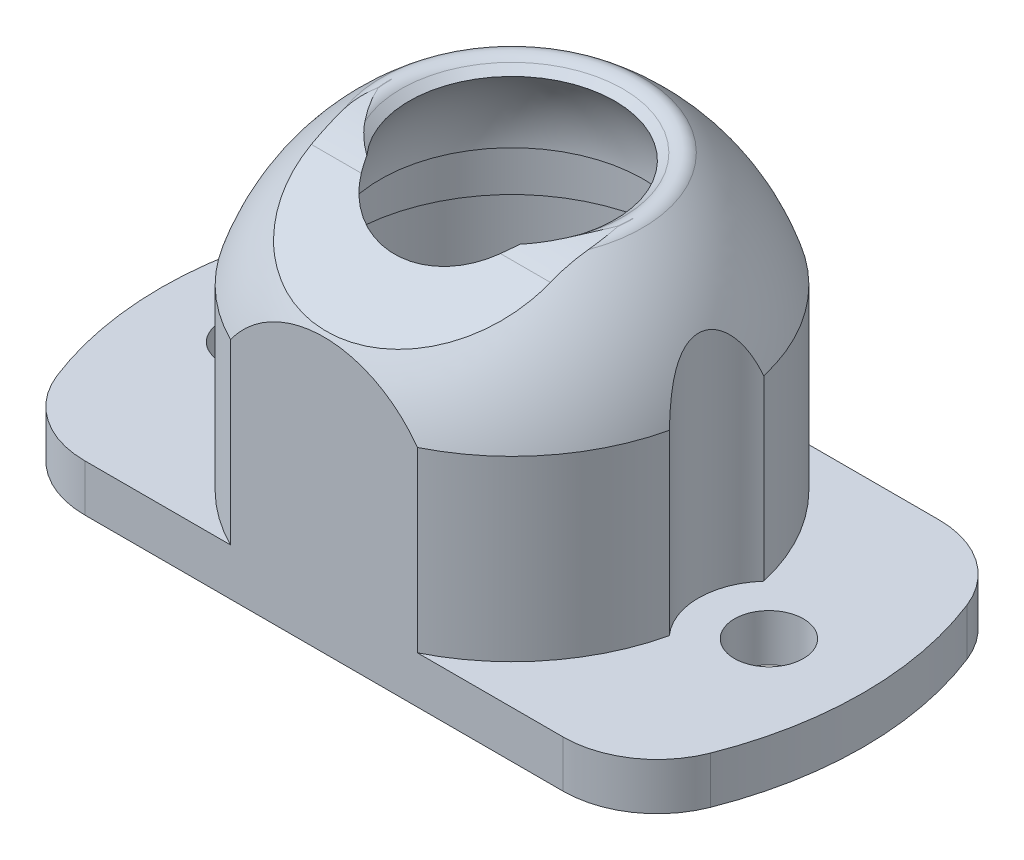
ISO-10303-21;
HEADER;
FILE_DESCRIPTION(('STEP AP214'),'2;1');
FILE_NAME('part.step','',(''),(''),'','','');
FILE_SCHEMA(('AUTOMOTIVE_DESIGN { 1 0 10303 214 1 1 1 1 }'));
ENDSEC;
DATA;
#1=APPLICATION_CONTEXT('core data for automotive mechanical design processes');
#2=APPLICATION_PROTOCOL_DEFINITION('international standard','automotive_design',2000,#1);
#3=PRODUCT_CONTEXT('',#1,'mechanical');
#4=PRODUCT('Part','Part','',(#3));
#5=PRODUCT_RELATED_PRODUCT_CATEGORY('part','',(#4));
#6=PRODUCT_DEFINITION_FORMATION('','',#4);
#7=PRODUCT_DEFINITION_CONTEXT('part definition',#1,'design');
#8=PRODUCT_DEFINITION('design','',#6,#7);
#9=PRODUCT_DEFINITION_SHAPE('','',#8);
#10=(LENGTH_UNIT() NAMED_UNIT(*) SI_UNIT(.MILLI.,.METRE.));
#11=(NAMED_UNIT(*) PLANE_ANGLE_UNIT() SI_UNIT($,.RADIAN.));
#12=(NAMED_UNIT(*) SI_UNIT($,.STERADIAN.) SOLID_ANGLE_UNIT());
#13=UNCERTAINTY_MEASURE_WITH_UNIT(LENGTH_MEASURE(1.E-05),#10,'distance_accuracy_value','');
#14=(GEOMETRIC_REPRESENTATION_CONTEXT(3) GLOBAL_UNCERTAINTY_ASSIGNED_CONTEXT((#13)) GLOBAL_UNIT_ASSIGNED_CONTEXT((#10,
#11,#12)) REPRESENTATION_CONTEXT('',''));
#15=CARTESIAN_POINT('',(0.,0.,0.));
#16=DIRECTION('',(0.,0.,1.));
#17=DIRECTION('',(1.,0.,0.));
#18=AXIS2_PLACEMENT_3D('',#15,#16,#17);
#19=CARTESIAN_POINT('',(0.,1.09968599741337,0.));
#20=DIRECTION('',(0.,-1.,0.));
#21=DIRECTION('',(0.,0.,-1.));
#22=AXIS2_PLACEMENT_3D('',#19,#20,#21);
#23=DEGENERATE_TOROIDAL_SURFACE('',#22,0.475592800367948,7.52808298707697,.F.);
#24=CARTESIAN_POINT('',(3.81435202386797,6.64993697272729,2.58959174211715));
#25=CARTESIAN_POINT('',(3.81885733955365,6.6929017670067,2.49948715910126));
#26=CARTESIAN_POINT('',(3.8240184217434,6.7331474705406,2.40812182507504));
#27=CARTESIAN_POINT('',(3.83550112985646,6.80794471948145,2.2235491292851));
#28=CARTESIAN_POINT('',(3.84181845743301,6.84251648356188,2.13034969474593));
#29=CARTESIAN_POINT('',(3.85549730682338,6.90602422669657,1.94212793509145));
#30=CARTESIAN_POINT('',(3.86285881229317,6.9349602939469,1.84710563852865));
#31=CARTESIAN_POINT('',(3.87852665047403,6.98720786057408,1.65522768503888));
#32=CARTESIAN_POINT('',(3.88683634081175,7.0104983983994,1.55836659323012));
#33=CARTESIAN_POINT('',(3.89554277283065,7.03086511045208,1.46093103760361));
#34=B_SPLINE_CURVE_WITH_KNOTS('',3,(#24,#25,#26,#27,#28,#29,#30,#31,#32,#33),.UNSPECIFIED.,.F.,
.F.,(4,2,2,2,4),(0.,0.299725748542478,0.598359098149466,0.896987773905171,1.19670881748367),.UNSPECIFIED.);
#35=CARTESIAN_POINT('',(3.81436202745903,6.65003232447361,2.58939174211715));
#36=VERTEX_POINT('',#35);
#37=CARTESIAN_POINT('',(3.89545733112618,7.03066511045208,1.46188721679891));
#38=VERTEX_POINT('',#37);
#39=EDGE_CURVE('E507',#36,#38,#34,.T.);
#40=ORIENTED_EDGE('',*,*,#39,.F.);
#41=CARTESIAN_POINT('',(-3.81437202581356,6.6501276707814,2.58919174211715));
#42=CARTESIAN_POINT('',(-3.80928812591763,6.60162967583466,2.69092194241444));
#43=CARTESIAN_POINT('',(-3.79940044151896,6.55324819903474,2.79240773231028));
#44=CARTESIAN_POINT('',(-3.77005733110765,6.45702329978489,2.99425068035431));
#45=CARTESIAN_POINT('',(-3.75060140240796,6.40917990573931,3.09460777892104));
#46=CARTESIAN_POINT('',(-3.67800023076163,6.26703498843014,3.39277332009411));
#47=CARTESIAN_POINT('',(-3.61060927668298,6.17400177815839,3.58792132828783));
#48=CARTESIAN_POINT('',(-3.44110795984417,5.99598762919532,3.96132676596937));
#49=CARTESIAN_POINT('',(-3.33963954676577,5.9108925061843,4.13982371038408));
#50=CARTESIAN_POINT('',(-3.10445563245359,5.74942610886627,4.47851830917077));
#51=CARTESIAN_POINT('',(-2.97075547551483,5.67305070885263,4.63872461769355));
#52=CARTESIAN_POINT('',(-2.67720183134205,5.53246818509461,4.9336128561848));
#53=CARTESIAN_POINT('',(-2.51780115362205,5.46808587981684,5.06866224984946));
#54=CARTESIAN_POINT('',(-2.17581211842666,5.35192998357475,5.31231278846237));
#55=CARTESIAN_POINT('',(-1.99322089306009,5.30015795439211,5.42091065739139));
#56=CARTESIAN_POINT('',(-1.61275948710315,5.21144113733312,5.6070045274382));
#57=CARTESIAN_POINT('',(-1.41513217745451,5.17430341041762,5.68490524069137));
#58=CARTESIAN_POINT('',(-1.00812224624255,5.11498489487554,5.80933274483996));
#59=CARTESIAN_POINT('',(-0.798741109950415,5.09280222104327,5.85586349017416));
#60=CARTESIAN_POINT('',(-0.37619764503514,5.06419752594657,5.91586517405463));
#61=CARTESIAN_POINT('',(-0.16308689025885,5.05763427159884,5.92963236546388));
#62=CARTESIAN_POINT('',(0.262654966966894,5.06005211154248,5.92456066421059));
#63=CARTESIAN_POINT('',(0.475286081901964,5.06903279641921,5.90572263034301));
#64=CARTESIAN_POINT('',(0.893319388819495,5.10221274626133,5.83612381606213));
#65=CARTESIAN_POINT('',(1.09874271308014,5.12636275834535,5.78546634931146));
#66=CARTESIAN_POINT('',(1.49730839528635,5.1891170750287,5.65383185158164));
#67=CARTESIAN_POINT('',(1.69044990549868,5.22772237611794,5.57285273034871));
#68=CARTESIAN_POINT('',(2.05966836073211,5.31839483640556,5.38265667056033));
#69=CARTESIAN_POINT('',(2.23568779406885,5.37050534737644,5.27334879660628));
#70=CARTESIAN_POINT('',(2.56509056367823,5.4865876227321,5.02985268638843));
#71=CARTESIAN_POINT('',(2.71847744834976,5.55055752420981,4.89566835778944));
#72=CARTESIAN_POINT('',(2.99980605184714,5.68914291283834,4.60496934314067));
#73=CARTESIAN_POINT('',(3.12751012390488,5.76384775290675,4.44826722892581));
#74=CARTESIAN_POINT('',(3.35244994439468,5.92133805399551,4.1179129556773));
#75=CARTESIAN_POINT('',(3.44967203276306,6.00412711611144,3.94425324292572));
#76=CARTESIAN_POINT('',(3.61429137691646,6.17881410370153,3.57782691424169));
#77=CARTESIAN_POINT('',(3.68039489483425,6.27094010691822,3.38458187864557));
#78=CARTESIAN_POINT('',(3.75165500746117,6.41165498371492,3.08941601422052));
#79=CARTESIAN_POINT('',(3.7707625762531,6.45901311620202,2.99007680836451));
#80=CARTESIAN_POINT('',(3.79960507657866,6.55425201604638,2.79030210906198));
#81=CARTESIAN_POINT('',(3.80934065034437,6.60213274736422,2.68986669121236));
#82=CARTESIAN_POINT('',(3.81437202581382,6.65012767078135,2.58919174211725));
#83=B_SPLINE_CURVE_WITH_KNOTS('',3,(#41,#42,#43,#44,#45,#46,#47,#48,#49,#50,#51,#52,#53,#54,#55,
#56,#57,#58,#59,#60,#61,#62,#63,#64,#65,#66,#67,#68,#69,#70,#71,#72,#73,#74,#75,#76,#77,#78,#79,
#80,#81,#82),.UNSPECIFIED.,.F.,.F.,(4,2,2,2,2,2,2,2,2,2,2,2,2,2,2,2,2,2,2,2,4),(0.,
0.338229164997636,0.676476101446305,1.35216454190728,2.01577854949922,2.67907725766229,
3.3317603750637,3.98452428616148,4.62836855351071,5.27213164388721,5.9100512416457,
6.54795403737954,7.18379627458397,7.81968235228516,8.45763546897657,9.09548845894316,
9.73899649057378,10.3827924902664,11.051398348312,11.3861448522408,11.7208684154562),.UNSPECIFIED.);
#84=CARTESIAN_POINT('',(-3.81436202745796,6.65003232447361,2.58939174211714));
#85=VERTEX_POINT('',#84);
#86=EDGE_CURVE('E305',#85,#36,#83,.T.);
#87=ORIENTED_EDGE('',*,*,#86,.F.);
#88=CARTESIAN_POINT('',(-3.89554277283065,7.03086511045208,1.46093103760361));
#89=CARTESIAN_POINT('',(-3.88683634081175,7.01049839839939,1.55836659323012));
#90=CARTESIAN_POINT('',(-3.87852665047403,6.98720786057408,1.65522768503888));
#91=CARTESIAN_POINT('',(-3.86285881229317,6.9349602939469,1.84710563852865));
#92=CARTESIAN_POINT('',(-3.85549730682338,6.90602422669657,1.94212793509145));
#93=CARTESIAN_POINT('',(-3.84181845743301,6.84251648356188,2.13034969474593));
#94=CARTESIAN_POINT('',(-3.83550112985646,6.80794471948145,2.2235491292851));
#95=CARTESIAN_POINT('',(-3.8240184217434,6.7331474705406,2.40812182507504));
#96=CARTESIAN_POINT('',(-3.81885733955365,6.6929017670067,2.49948715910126));
#97=CARTESIAN_POINT('',(-3.81435202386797,6.64993697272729,2.58959174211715));
#98=B_SPLINE_CURVE_WITH_KNOTS('',3,(#88,#89,#90,#91,#92,#93,#94,#95,#96,#97),.UNSPECIFIED.,.F.,
.F.,(4,2,2,2,4),(0.,0.299721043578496,0.5983497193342,0.896983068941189,1.19670881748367),.UNSPECIFIED.);
#99=CARTESIAN_POINT('',(-3.89545733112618,7.03066511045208,1.46188721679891));
#100=VERTEX_POINT('',#99);
#101=EDGE_CURVE('E311',#100,#85,#98,.T.);
#102=ORIENTED_EDGE('',*,*,#101,.F.);
#103=CARTESIAN_POINT('',(0.,7.03066511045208,0.));
#104=DIRECTION('',(0.,-1.,0.));
#105=DIRECTION('',(0.,0.,-1.));
#106=AXIS2_PLACEMENT_3D('',#103,#104,#105);
#107=CIRCLE('',#106,4.16073335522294);
#108=EDGE_CURVE('E241',#100,#38,#107,.T.);
#109=ORIENTED_EDGE('',*,*,#108,.T.);
#110=EDGE_LOOP('',(#40,#87,#102,#109));
#111=FACE_BOUND('',#110,.T.);
#112=CARTESIAN_POINT('',(0.,3.37628464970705,0.));
#113=DIRECTION('',(0.,-1.,0.));
#114=DIRECTION('',(0.,0.,-1.));
#115=AXIS2_PLACEMENT_3D('',#112,#113,#114);
#116=CIRCLE('',#115,6.7);
#117=CARTESIAN_POINT('',(-6.52850609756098,3.37628464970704,-1.5061899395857));
#118=VERTEX_POINT('',#117);
#119=CARTESIAN_POINT('',(-2.98161030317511,3.37628464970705,-6.));
#120=VERTEX_POINT('',#119);
#121=EDGE_CURVE('E228',#118,#120,#116,.T.);
#122=ORIENTED_EDGE('',*,*,#121,.F.);
#123=CARTESIAN_POINT('',(-6.58465044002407,3.14837002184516,-1.5662521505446));
#124=CARTESIAN_POINT('',(-6.56381282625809,3.23767845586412,-1.54471818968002));
#125=CARTESIAN_POINT('',(-6.54176832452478,3.32626280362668,-1.52116284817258));
#126=CARTESIAN_POINT('',(-6.49553528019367,3.50171326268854,-1.46920053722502));
#127=CARTESIAN_POINT('',(-6.47134076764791,3.58857371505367,-1.44077984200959));
#128=CARTESIAN_POINT('',(-6.42099375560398,3.7604950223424,-1.37813535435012));
#129=CARTESIAN_POINT('',(-6.39482673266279,3.84553508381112,-1.34386556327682));
#130=CARTESIAN_POINT('',(-6.34125804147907,4.01215085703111,-1.2687433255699));
#131=CARTESIAN_POINT('',(-6.3138580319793,4.09373095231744,-1.22789954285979));
#132=CARTESIAN_POINT('',(-6.26123436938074,4.24457583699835,-1.1427772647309));
#133=CARTESIAN_POINT('',(-6.23606031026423,4.3142643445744,-1.09922665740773));
#134=CARTESIAN_POINT('',(-6.18607032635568,4.44860049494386,-1.00471139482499));
#135=CARTESIAN_POINT('',(-6.16125425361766,4.51325027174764,-0.95374990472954));
#136=CARTESIAN_POINT('',(-6.11285431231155,4.63622637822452,-0.842641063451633));
#137=CARTESIAN_POINT('',(-6.08928741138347,4.69447354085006,-0.78239698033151));
#138=CARTESIAN_POINT('',(-6.04551680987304,4.80052280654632,-0.652212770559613));
#139=CARTESIAN_POINT('',(-6.02530416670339,4.84835279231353,-0.582299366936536));
#140=CARTESIAN_POINT('',(-5.9967179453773,4.91510094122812,-0.45886173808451));
#141=CARTESIAN_POINT('',(-5.98666867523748,4.93829492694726,-0.408049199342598));
#142=CARTESIAN_POINT('',(-5.96986329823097,4.9768519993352,-0.30300066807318));
#143=CARTESIAN_POINT('',(-5.96310415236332,4.99222231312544,-0.248767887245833));
#144=CARTESIAN_POINT('',(-5.95352623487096,5.01394972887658,-0.1377511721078));
#145=CARTESIAN_POINT('',(-5.95073508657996,5.02024364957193,-0.0809521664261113));
#146=CARTESIAN_POINT('',(-5.94952114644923,5.02298494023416,0.0329309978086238));
#147=CARTESIAN_POINT('',(-5.95109758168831,5.01943405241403,0.0900151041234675));
#148=CARTESIAN_POINT('',(-5.9580817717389,5.00362174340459,0.19730844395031));
#149=CARTESIAN_POINT('',(-5.96312530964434,4.99218809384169,0.247668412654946));
#150=CARTESIAN_POINT('',(-5.97618775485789,4.96236657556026,0.345856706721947));
#151=CARTESIAN_POINT('',(-5.98420796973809,4.94397565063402,0.393683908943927));
#152=CARTESIAN_POINT('',(-6.00655787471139,4.89224052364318,0.505791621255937));
#153=CARTESIAN_POINT('',(-6.02212036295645,4.85586314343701,0.568422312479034));
#154=CARTESIAN_POINT('',(-6.0564238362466,4.77422588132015,0.686575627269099));
#155=CARTESIAN_POINT('',(-6.07517108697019,4.72894846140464,0.742083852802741));
#156=CARTESIAN_POINT('',(-6.12586251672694,4.60386958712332,0.876476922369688));
#157=CARTESIAN_POINT('',(-6.15916900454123,4.51924466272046,0.95031768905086));
#158=CARTESIAN_POINT('',(-6.22697309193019,4.33964290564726,1.08412201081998));
#159=CARTESIAN_POINT('',(-6.26147670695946,4.24460620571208,1.14399837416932));
#160=CARTESIAN_POINT('',(-6.32250615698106,4.0681594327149,1.24099562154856));
#161=CARTESIAN_POINT('',(-6.34921349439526,3.9879659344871,1.28026391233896));
#162=CARTESIAN_POINT('',(-6.40139741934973,3.82435767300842,1.35259751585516));
#163=CARTESIAN_POINT('',(-6.42687270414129,3.74093966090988,1.3856563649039));
#164=CARTESIAN_POINT('',(-6.47555799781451,3.57354403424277,1.44577604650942));
#165=CARTESIAN_POINT('',(-6.49880513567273,3.4896177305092,1.47295134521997));
#166=CARTESIAN_POINT('',(-6.54328912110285,3.32014152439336,1.52279049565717));
#167=CARTESIAN_POINT('',(-6.56453069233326,3.23459603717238,1.54546509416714));
#168=CARTESIAN_POINT('',(-6.58465044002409,3.14837002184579,1.56625215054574));
#169=B_SPLINE_CURVE_WITH_KNOTS('',3,(#123,#124,#125,#126,#127,#128,#129,#130,#131,#132,#133,
#134,#135,#136,#137,#138,#139,#140,#141,#142,#143,#144,#145,#146,#147,#148,#149,#150,#151,#152,
#153,#154,#155,#156,#157,#158,#159,#160,#161,#162,#163,#164,#165,#166,#167,#168),.UNSPECIFIED.,
.F.,.F.,(4,2,2,2,2,2,2,2,2,2,2,2,2,2,2,2,2,2,2,2,2,2,4),(0.,0.282636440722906,0.566083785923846,
0.851872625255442,1.13728785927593,1.39475679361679,1.6521160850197,1.91236557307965,
2.17190967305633,2.34154946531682,2.51103226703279,2.68168924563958,2.85231602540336,
3.00731170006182,3.16237554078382,3.38336512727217,3.60479463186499,3.95427199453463,
4.30587627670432,4.58517858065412,4.86477003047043,5.13830192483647,5.41117260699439),.UNSPECIFIED.);
#170=CARTESIAN_POINT('',(-6.52850609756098,3.37628464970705,1.5061899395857));
#171=VERTEX_POINT('',#170);
#172=EDGE_CURVE('E213',#118,#171,#169,.T.);
#173=ORIENTED_EDGE('',*,*,#172,.T.);
#174=CARTESIAN_POINT('',(-2.98161030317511,3.37628464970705,6.));
#175=VERTEX_POINT('',#174);
#176=EDGE_CURVE('E212',#175,#171,#116,.T.);
#177=ORIENTED_EDGE('',*,*,#176,.F.);
#178=CARTESIAN_POINT('',(0.,4.93879153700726,6.));
#179=CARTESIAN_POINT('',(-0.202739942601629,4.93878052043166,6.));
#180=CARTESIAN_POINT('',(-0.405636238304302,4.92138475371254,6.));
#181=CARTESIAN_POINT('',(-0.805693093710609,4.85239110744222,6.));
#182=CARTESIAN_POINT('',(-1.00284602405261,4.80074972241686,6.));
#183=CARTESIAN_POINT('',(-1.38540259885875,4.66522226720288,6.));
#184=CARTESIAN_POINT('',(-1.57082310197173,4.58138374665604,6.));
#185=CARTESIAN_POINT('',(-1.92524358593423,4.38432784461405,6.));
#186=CARTESIAN_POINT('',(-2.09424623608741,4.27111524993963,6.));
#187=CARTESIAN_POINT('',(-2.41450333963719,4.01659978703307,6.));
#188=CARTESIAN_POINT('',(-2.56538950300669,3.87483397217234,6.));
#189=CARTESIAN_POINT('',(-2.8422239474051,3.56875340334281,6.));
#190=CARTESIAN_POINT('',(-2.96816780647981,3.40443465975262,6.));
#191=CARTESIAN_POINT('',(-3.19618556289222,3.05167819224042,6.));
#192=CARTESIAN_POINT('',(-3.29725869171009,2.86259335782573,6.));
#193=CARTESIAN_POINT('',(-3.46718850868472,2.47046319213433,6.));
#194=CARTESIAN_POINT('',(-3.53604034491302,2.26741576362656,6.));
#195=CARTESIAN_POINT('',(-3.6413480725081,1.84723428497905,6.));
#196=CARTESIAN_POINT('',(-3.67687823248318,1.62986784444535,6.));
#197=CARTESIAN_POINT('',(-3.71143509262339,1.19224660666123,6.));
#198=CARTESIAN_POINT('',(-3.71045861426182,0.971991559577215,6.));
#199=CARTESIAN_POINT('',(-3.67177987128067,0.531965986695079,6.));
#200=CARTESIAN_POINT('',(-3.63362325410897,0.312235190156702,6.));
#201=CARTESIAN_POINT('',(-3.52083430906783,-0.117673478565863,6.));
#202=CARTESIAN_POINT('',(-3.44620123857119,-0.327851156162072,6.));
#203=CARTESIAN_POINT('',(-3.26265036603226,-0.731735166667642,6.));
#204=CARTESIAN_POINT('',(-3.15386153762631,-0.925500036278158,6.));
#205=CARTESIAN_POINT('',(-2.90466726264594,-1.2915328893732,6.));
#206=CARTESIAN_POINT('',(-2.76426412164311,-1.46380243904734,6.));
#207=CARTESIAN_POINT('',(-2.4586943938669,-1.77806307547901,6.));
#208=CARTESIAN_POINT('',(-2.29408408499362,-1.92059454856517,6.));
#209=CARTESIAN_POINT('',(-1.94256529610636,-2.17485246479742,6.));
#210=CARTESIAN_POINT('',(-1.75566137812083,-2.28658519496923,6.));
#211=CARTESIAN_POINT('',(-1.37158138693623,-2.47197917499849,6.));
#212=CARTESIAN_POINT('',(-1.17496314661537,-2.54679573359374,6.));
#213=CARTESIAN_POINT('',(-0.771710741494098,-2.6610555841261,6.));
#214=CARTESIAN_POINT('',(-0.565079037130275,-2.70050751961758,6.));
#215=CARTESIAN_POINT('',(-0.155105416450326,-2.74179808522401,6.));
#216=CARTESIAN_POINT('',(0.0481147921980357,-2.74485256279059,6.));
#217=CARTESIAN_POINT('',(0.452104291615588,-2.71638123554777,6.));
#218=CARTESIAN_POINT('',(0.652873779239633,-2.68485822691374,6.));
#219=CARTESIAN_POINT('',(1.04406972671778,-2.58893434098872,6.));
#220=CARTESIAN_POINT('',(1.23458437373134,-2.52489166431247,6.));
#221=CARTESIAN_POINT('',(1.60246955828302,-2.36634470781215,6.));
#222=CARTESIAN_POINT('',(1.77983901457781,-2.27183792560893,6.));
#223=CARTESIAN_POINT('',(2.120305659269,-2.0532332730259,6.));
#224=CARTESIAN_POINT('',(2.28304769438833,-1.92858288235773,6.));
#225=CARTESIAN_POINT('',(2.5861883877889,-1.65457930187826,6.));
#226=CARTESIAN_POINT('',(2.72658355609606,-1.5052222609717,6.));
#227=CARTESIAN_POINT('',(2.98622020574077,-1.18047791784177,6.));
#228=CARTESIAN_POINT('',(3.1045541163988,-1.00436493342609,6.));
#229=CARTESIAN_POINT('',(3.31100623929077,-0.63524385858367,6.));
#230=CARTESIAN_POINT('',(3.39911974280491,-0.442233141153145,6.));
#231=CARTESIAN_POINT('',(3.54532467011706,-0.0384363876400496,6.));
#232=CARTESIAN_POINT('',(3.60241333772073,0.172713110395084,6.));
#233=CARTESIAN_POINT('',(3.68099943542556,0.601539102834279,6.));
#234=CARTESIAN_POINT('',(3.70249286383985,0.819216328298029,6.));
#235=CARTESIAN_POINT('',(3.70943737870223,1.25889904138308,6.));
#236=CARTESIAN_POINT('',(3.69426335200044,1.48091467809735,6.));
#237=CARTESIAN_POINT('',(3.6269215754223,1.91927590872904,6.));
#238=CARTESIAN_POINT('',(3.57475226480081,2.13562126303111,6.));
#239=CARTESIAN_POINT('',(3.43459444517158,2.55671873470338,6.));
#240=CARTESIAN_POINT('',(3.34655857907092,2.76145511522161,6.));
#241=CARTESIAN_POINT('',(3.13686157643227,3.15293184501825,6.));
#242=CARTESIAN_POINT('',(3.01520304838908,3.33967358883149,6.));
#243=CARTESIAN_POINT('',(2.74350958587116,3.68666253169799,6.));
#244=CARTESIAN_POINT('',(2.59393539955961,3.84727015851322,6.));
#245=CARTESIAN_POINT('',(2.26915336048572,4.14018648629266,6.));
#246=CARTESIAN_POINT('',(2.09394287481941,4.27249227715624,6.));
#247=CARTESIAN_POINT('',(1.72844792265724,4.5006267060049,6.));
#248=CARTESIAN_POINT('',(1.53876799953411,4.5974245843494,6.));
#249=CARTESIAN_POINT('',(1.14559034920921,4.75631310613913,6.));
#250=CARTESIAN_POINT('',(0.942114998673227,4.81845851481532,6.));
#251=CARTESIAN_POINT('',(0.614168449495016,4.88757856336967,6.));
#252=CARTESIAN_POINT('',(0.492145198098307,4.90675339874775,6.));
#253=CARTESIAN_POINT('',(0.246767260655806,4.93236312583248,6.));
#254=CARTESIAN_POINT('',(0.123412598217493,4.93879824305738,6.));
#255=CARTESIAN_POINT('',(0.,4.93879153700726,6.));
#256=B_SPLINE_CURVE_WITH_KNOTS('',3,(#178,#179,#180,#181,#182,#183,#184,#185,#186,#187,#188,
#189,#190,#191,#192,#193,#194,#195,#196,#197,#198,#199,#200,#201,#202,#203,#204,#205,#206,#207,
#208,#209,#210,#211,#212,#213,#214,#215,#216,#217,#218,#219,#220,#221,#222,#223,#224,#225,#226,
#227,#228,#229,#230,#231,#232,#233,#234,#235,#236,#237,#238,#239,#240,#241,#242,#243,#244,#245,
#246,#247,#248,#249,#250,#251,#252,#253,#254,#255),.UNSPECIFIED.,.T.,.F.,(4,2,2,2,2,2,2,2,2,2,2,
2,2,2,2,2,2,2,2,2,2,2,2,2,2,2,2,2,2,2,2,2,2,2,2,2,2,2,4),(0.,0.607755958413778,1.21628549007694,
1.82391976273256,2.43145507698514,3.04977447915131,3.66820340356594,4.30848592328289,
4.9488648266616,5.60654899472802,6.26429042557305,6.93017177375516,7.59606667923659,
8.25947677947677,8.92283851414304,9.57282723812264,10.2226831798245,10.8506561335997,
11.4784755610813,12.0852616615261,12.6919986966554,13.2921930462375,13.8924367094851,
14.5046503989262,15.1169596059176,15.7506048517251,16.3843487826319,17.0375134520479,
17.6907515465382,18.3552044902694,19.0196854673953,19.6850466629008,20.3503562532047,
21.0055257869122,21.6607626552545,22.2964800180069,22.9311898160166,23.3011517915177,
23.6711072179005),.UNSPECIFIED.);
#257=CARTESIAN_POINT('',(2.98161030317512,3.37628464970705,6.));
#258=VERTEX_POINT('',#257);
#259=EDGE_CURVE('E363',#258,#175,#256,.T.);
#260=ORIENTED_EDGE('',*,*,#259,.F.);
#261=CARTESIAN_POINT('',(6.52850609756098,3.37628464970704,1.5061899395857));
#262=VERTEX_POINT('',#261);
#263=EDGE_CURVE('E233',#262,#258,#116,.T.);
#264=ORIENTED_EDGE('',*,*,#263,.F.);
#265=CARTESIAN_POINT('',(6.58465044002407,3.14837002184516,1.5662521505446));
#266=CARTESIAN_POINT('',(6.56381282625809,3.23767845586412,1.54471818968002));
#267=CARTESIAN_POINT('',(6.54176832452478,3.32626280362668,1.52116284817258));
#268=CARTESIAN_POINT('',(6.49553528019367,3.50171326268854,1.46920053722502));
#269=CARTESIAN_POINT('',(6.47134076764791,3.58857371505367,1.44077984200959));
#270=CARTESIAN_POINT('',(6.42099375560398,3.7604950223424,1.37813535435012));
#271=CARTESIAN_POINT('',(6.39482673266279,3.84553508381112,1.34386556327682));
#272=CARTESIAN_POINT('',(6.34125804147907,4.01215085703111,1.2687433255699));
#273=CARTESIAN_POINT('',(6.3138580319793,4.09373095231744,1.22789954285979));
#274=CARTESIAN_POINT('',(6.26123436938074,4.24457583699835,1.1427772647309));
#275=CARTESIAN_POINT('',(6.23606031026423,4.3142643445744,1.09922665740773));
#276=CARTESIAN_POINT('',(6.18607032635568,4.44860049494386,1.00471139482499));
#277=CARTESIAN_POINT('',(6.16125425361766,4.51325027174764,0.95374990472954));
#278=CARTESIAN_POINT('',(6.11285431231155,4.63622637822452,0.842641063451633));
#279=CARTESIAN_POINT('',(6.08928741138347,4.69447354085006,0.78239698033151));
#280=CARTESIAN_POINT('',(6.04551680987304,4.80052280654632,0.652212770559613));
#281=CARTESIAN_POINT('',(6.02530416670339,4.84835279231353,0.582299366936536));
#282=CARTESIAN_POINT('',(5.9967179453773,4.91510094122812,0.45886173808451));
#283=CARTESIAN_POINT('',(5.98666867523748,4.93829492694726,0.408049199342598));
#284=CARTESIAN_POINT('',(5.96986329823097,4.9768519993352,0.30300066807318));
#285=CARTESIAN_POINT('',(5.96310415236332,4.99222231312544,0.248767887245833));
#286=CARTESIAN_POINT('',(5.95352623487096,5.01394972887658,0.1377511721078));
#287=CARTESIAN_POINT('',(5.95073508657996,5.02024364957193,0.0809521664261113));
#288=CARTESIAN_POINT('',(5.94952114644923,5.02298494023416,-0.0329309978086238));
#289=CARTESIAN_POINT('',(5.95109758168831,5.01943405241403,-0.0900151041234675));
#290=CARTESIAN_POINT('',(5.9580817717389,5.00362174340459,-0.19730844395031));
#291=CARTESIAN_POINT('',(5.96312530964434,4.99218809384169,-0.247668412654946));
#292=CARTESIAN_POINT('',(5.97618775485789,4.96236657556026,-0.345856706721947));
#293=CARTESIAN_POINT('',(5.98420796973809,4.94397565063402,-0.393683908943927));
#294=CARTESIAN_POINT('',(6.00655787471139,4.89224052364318,-0.505791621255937));
#295=CARTESIAN_POINT('',(6.02212036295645,4.85586314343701,-0.568422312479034));
#296=CARTESIAN_POINT('',(6.0564238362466,4.77422588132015,-0.686575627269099));
#297=CARTESIAN_POINT('',(6.07517108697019,4.72894846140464,-0.742083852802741));
#298=CARTESIAN_POINT('',(6.12586251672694,4.60386958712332,-0.876476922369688));
#299=CARTESIAN_POINT('',(6.15916900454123,4.51924466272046,-0.95031768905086));
#300=CARTESIAN_POINT('',(6.22697309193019,4.33964290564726,-1.08412201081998));
#301=CARTESIAN_POINT('',(6.26147670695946,4.24460620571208,-1.14399837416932));
#302=CARTESIAN_POINT('',(6.32250615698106,4.0681594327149,-1.24099562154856));
#303=CARTESIAN_POINT('',(6.34921349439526,3.9879659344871,-1.28026391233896));
#304=CARTESIAN_POINT('',(6.40139741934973,3.82435767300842,-1.35259751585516));
#305=CARTESIAN_POINT('',(6.42687270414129,3.74093966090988,-1.3856563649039));
#306=CARTESIAN_POINT('',(6.47555799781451,3.57354403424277,-1.44577604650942));
#307=CARTESIAN_POINT('',(6.49880513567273,3.4896177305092,-1.47295134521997));
#308=CARTESIAN_POINT('',(6.54328912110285,3.32014152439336,-1.52279049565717));
#309=CARTESIAN_POINT('',(6.56453069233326,3.23459603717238,-1.54546509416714));
#310=CARTESIAN_POINT('',(6.58465044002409,3.14837002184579,-1.56625215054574));
#311=B_SPLINE_CURVE_WITH_KNOTS('',3,(#265,#266,#267,#268,#269,#270,#271,#272,#273,#274,#275,
#276,#277,#278,#279,#280,#281,#282,#283,#284,#285,#286,#287,#288,#289,#290,#291,#292,#293,#294,
#295,#296,#297,#298,#299,#300,#301,#302,#303,#304,#305,#306,#307,#308,#309,#310),.UNSPECIFIED.,
.F.,.F.,(4,2,2,2,2,2,2,2,2,2,2,2,2,2,2,2,2,2,2,2,2,2,4),(0.,0.282636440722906,0.566083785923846,
0.851872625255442,1.13728785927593,1.39475679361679,1.6521160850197,1.91236557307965,
2.17190967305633,2.34154946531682,2.51103226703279,2.68168924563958,2.85231602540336,
3.00731170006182,3.16237554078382,3.38336512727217,3.60479463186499,3.95427199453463,
4.30587627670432,4.58517858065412,4.86477003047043,5.13830192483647,5.41117260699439),.UNSPECIFIED.);
#312=CARTESIAN_POINT('',(6.52850609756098,3.37628464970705,-1.5061899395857));
#313=VERTEX_POINT('',#312);
#314=EDGE_CURVE('E11',#262,#313,#311,.T.);
#315=ORIENTED_EDGE('',*,*,#314,.T.);
#316=CARTESIAN_POINT('',(2.98161030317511,3.37628464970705,-6.));
#317=VERTEX_POINT('',#316);
#318=EDGE_CURVE('E234',#317,#313,#116,.T.);
#319=ORIENTED_EDGE('',*,*,#318,.F.);
#320=CARTESIAN_POINT('',(0.,4.93879153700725,-6.));
#321=CARTESIAN_POINT('',(0.202739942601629,4.93878052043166,-6.));
#322=CARTESIAN_POINT('',(0.405636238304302,4.92138475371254,-6.));
#323=CARTESIAN_POINT('',(0.805693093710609,4.85239110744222,-6.));
#324=CARTESIAN_POINT('',(1.00284602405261,4.80074972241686,-6.));
#325=CARTESIAN_POINT('',(1.38540259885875,4.66522226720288,-6.));
#326=CARTESIAN_POINT('',(1.57082310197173,4.58138374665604,-6.));
#327=CARTESIAN_POINT('',(1.92524358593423,4.38432784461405,-6.));
#328=CARTESIAN_POINT('',(2.09424623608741,4.27111524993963,-6.));
#329=CARTESIAN_POINT('',(2.41450333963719,4.01659978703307,-6.));
#330=CARTESIAN_POINT('',(2.56538950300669,3.87483397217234,-6.));
#331=CARTESIAN_POINT('',(2.8422239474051,3.56875340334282,-6.));
#332=CARTESIAN_POINT('',(2.96816780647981,3.40443465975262,-6.));
#333=CARTESIAN_POINT('',(3.19618556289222,3.05167819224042,-6.));
#334=CARTESIAN_POINT('',(3.29725869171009,2.86259335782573,-6.));
#335=CARTESIAN_POINT('',(3.46718850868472,2.47046319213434,-6.));
#336=CARTESIAN_POINT('',(3.53604034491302,2.26741576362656,-6.));
#337=CARTESIAN_POINT('',(3.64134807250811,1.84723428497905,-6.));
#338=CARTESIAN_POINT('',(3.67687823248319,1.62986784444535,-6.));
#339=CARTESIAN_POINT('',(3.71143509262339,1.19224660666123,-6.));
#340=CARTESIAN_POINT('',(3.71045861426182,0.971991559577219,-6.));
#341=CARTESIAN_POINT('',(3.67177987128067,0.531965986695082,-6.));
#342=CARTESIAN_POINT('',(3.63362325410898,0.312235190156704,-6.));
#343=CARTESIAN_POINT('',(3.52083430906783,-0.117673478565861,-6.));
#344=CARTESIAN_POINT('',(3.44620123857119,-0.327851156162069,-6.));
#345=CARTESIAN_POINT('',(3.26265036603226,-0.731735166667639,-6.));
#346=CARTESIAN_POINT('',(3.15386153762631,-0.925500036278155,-6.));
#347=CARTESIAN_POINT('',(2.90466726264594,-1.2915328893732,-6.));
#348=CARTESIAN_POINT('',(2.76426412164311,-1.46380243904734,-6.));
#349=CARTESIAN_POINT('',(2.4586943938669,-1.778063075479,-6.));
#350=CARTESIAN_POINT('',(2.29408408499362,-1.92059454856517,-6.));
#351=CARTESIAN_POINT('',(1.94256529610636,-2.17485246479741,-6.));
#352=CARTESIAN_POINT('',(1.75566137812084,-2.28658519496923,-6.));
#353=CARTESIAN_POINT('',(1.37158138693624,-2.47197917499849,-6.));
#354=CARTESIAN_POINT('',(1.17496314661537,-2.54679573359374,-6.));
#355=CARTESIAN_POINT('',(0.771710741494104,-2.6610555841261,-6.));
#356=CARTESIAN_POINT('',(0.56507903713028,-2.70050751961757,-6.));
#357=CARTESIAN_POINT('',(0.15510541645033,-2.74179808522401,-6.));
#358=CARTESIAN_POINT('',(-0.0481147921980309,-2.74485256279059,-6.));
#359=CARTESIAN_POINT('',(-0.452104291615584,-2.71638123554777,-6.));
#360=CARTESIAN_POINT('',(-0.652873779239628,-2.68485822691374,-6.));
#361=CARTESIAN_POINT('',(-1.04406972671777,-2.58893434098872,-6.));
#362=CARTESIAN_POINT('',(-1.23458437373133,-2.52489166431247,-6.));
#363=CARTESIAN_POINT('',(-1.60246955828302,-2.36634470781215,-6.));
#364=CARTESIAN_POINT('',(-1.77983901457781,-2.27183792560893,-6.));
#365=CARTESIAN_POINT('',(-2.120305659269,-2.0532332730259,-6.));
#366=CARTESIAN_POINT('',(-2.28304769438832,-1.92858288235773,-6.));
#367=CARTESIAN_POINT('',(-2.5861883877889,-1.65457930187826,-6.));
#368=CARTESIAN_POINT('',(-2.72658355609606,-1.5052222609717,-6.));
#369=CARTESIAN_POINT('',(-2.98622020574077,-1.18047791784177,-6.));
#370=CARTESIAN_POINT('',(-3.10455411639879,-1.00436493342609,-6.));
#371=CARTESIAN_POINT('',(-3.31100623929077,-0.635243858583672,-6.));
#372=CARTESIAN_POINT('',(-3.3991197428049,-0.442233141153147,-6.));
#373=CARTESIAN_POINT('',(-3.54532467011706,-0.038436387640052,-6.));
#374=CARTESIAN_POINT('',(-3.60241333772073,0.172713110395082,-6.));
#375=CARTESIAN_POINT('',(-3.68099943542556,0.601539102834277,-6.));
#376=CARTESIAN_POINT('',(-3.70249286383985,0.819216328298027,-6.));
#377=CARTESIAN_POINT('',(-3.70943737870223,1.25889904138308,-6.));
#378=CARTESIAN_POINT('',(-3.69426335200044,1.48091467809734,-6.));
#379=CARTESIAN_POINT('',(-3.62692157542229,1.91927590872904,-6.));
#380=CARTESIAN_POINT('',(-3.57475226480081,2.13562126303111,-6.));
#381=CARTESIAN_POINT('',(-3.43459444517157,2.55671873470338,-6.));
#382=CARTESIAN_POINT('',(-3.34655857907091,2.76145511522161,-6.));
#383=CARTESIAN_POINT('',(-3.13686157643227,3.15293184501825,-6.));
#384=CARTESIAN_POINT('',(-3.01520304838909,3.33967358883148,-6.));
#385=CARTESIAN_POINT('',(-2.74350958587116,3.68666253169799,-6.));
#386=CARTESIAN_POINT('',(-2.59393539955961,3.84727015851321,-6.));
#387=CARTESIAN_POINT('',(-2.26915336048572,4.14018648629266,-6.));
#388=CARTESIAN_POINT('',(-2.0939428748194,4.27249227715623,-6.));
#389=CARTESIAN_POINT('',(-1.72844792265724,4.50062670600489,-6.));
#390=CARTESIAN_POINT('',(-1.53876799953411,4.5974245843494,-6.));
#391=CARTESIAN_POINT('',(-1.14559034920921,4.75631310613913,-6.));
#392=CARTESIAN_POINT('',(-0.942114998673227,4.81845851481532,-6.));
#393=CARTESIAN_POINT('',(-0.614168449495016,4.88757856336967,-6.));
#394=CARTESIAN_POINT('',(-0.492145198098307,4.90675339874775,-6.));
#395=CARTESIAN_POINT('',(-0.246767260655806,4.93236312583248,-6.));
#396=CARTESIAN_POINT('',(-0.123412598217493,4.93879824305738,-6.));
#397=CARTESIAN_POINT('',(0.,4.93879153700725,-6.));
#398=B_SPLINE_CURVE_WITH_KNOTS('',3,(#320,#321,#322,#323,#324,#325,#326,#327,#328,#329,#330,
#331,#332,#333,#334,#335,#336,#337,#338,#339,#340,#341,#342,#343,#344,#345,#346,#347,#348,#349,
#350,#351,#352,#353,#354,#355,#356,#357,#358,#359,#360,#361,#362,#363,#364,#365,#366,#367,#368,
#369,#370,#371,#372,#373,#374,#375,#376,#377,#378,#379,#380,#381,#382,#383,#384,#385,#386,#387,
#388,#389,#390,#391,#392,#393,#394,#395,#396,#397),.UNSPECIFIED.,.T.,.F.,(4,2,2,2,2,2,2,2,2,2,2,
2,2,2,2,2,2,2,2,2,2,2,2,2,2,2,2,2,2,2,2,2,2,2,2,2,2,2,4),(0.,0.607755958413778,1.21628549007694,
1.82391976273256,2.43145507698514,3.04977447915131,3.66820340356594,4.30848592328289,
4.9488648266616,5.60654899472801,6.26429042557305,6.93017177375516,7.59606667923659,
8.25947677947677,8.92283851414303,9.57282723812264,10.2226831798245,10.8506561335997,
11.4784755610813,12.0852616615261,12.6919986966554,13.2921930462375,13.892436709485,
14.5046503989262,15.1169596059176,15.750604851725,16.3843487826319,17.0375134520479,
17.6907515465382,18.3552044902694,19.0196854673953,19.6850466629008,20.3503562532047,
21.0055257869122,21.6607626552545,22.2964800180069,22.9311898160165,23.3011517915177,
23.6711072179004),.UNSPECIFIED.);
#399=EDGE_CURVE('E378',#120,#317,#398,.T.);
#400=ORIENTED_EDGE('',*,*,#399,.F.);
#401=EDGE_LOOP('',(#122,#173,#177,#260,#264,#315,#319,#400));
#402=FACE_BOUND('',#401,.T.);
#403=ADVANCED_FACE('F28',(#111,#402),#23,.F.);
#404=CARTESIAN_POINT('',(0.,0.,0.));
#405=DIRECTION('',(0.,-1.,0.));
#406=DIRECTION('',(0.,0.,-1.));
#407=AXIS2_PLACEMENT_3D('',#404,#405,#406);
#408=CYLINDRICAL_SURFACE('',#407,6.7);
#409=CARTESIAN_POINT('',(0.,-2.3,0.));
#410=DIRECTION('',(0.,-1.,0.));
#411=DIRECTION('',(0.,0.,-1.));
#412=AXIS2_PLACEMENT_3D('',#409,#410,#411);
#413=CIRCLE('',#412,6.7);
#414=CARTESIAN_POINT('',(-6.52850609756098,-2.3,-1.5061899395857));
#415=VERTEX_POINT('',#414);
#416=CARTESIAN_POINT('',(-2.98161030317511,-2.3,-6.));
#417=VERTEX_POINT('',#416);
#418=EDGE_CURVE('E221',#415,#417,#413,.T.);
#419=ORIENTED_EDGE('',*,*,#418,.F.);
#420=DIRECTION('',(0.,-1.,0.));
#421=VECTOR('',#420,1.);
#422=CARTESIAN_POINT('',(-6.52850609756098,2.7,-1.5061899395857));
#423=LINE('',#422,#421);
#424=EDGE_CURVE('E202',#415,#118,#423,.F.);
#425=ORIENTED_EDGE('',*,*,#424,.T.);
#426=ORIENTED_EDGE('',*,*,#121,.T.);
#427=DIRECTION('',(0.,-1.,0.));
#428=VECTOR('',#427,1.);
#429=CARTESIAN_POINT('',(-2.98161030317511,0.,-6.));
#430=LINE('',#429,#428);
#431=EDGE_CURVE('E376',#417,#120,#430,.F.);
#432=ORIENTED_EDGE('',*,*,#431,.F.);
#433=EDGE_LOOP('',(#419,#425,#426,#432));
#434=FACE_BOUND('',#433,.T.);
#435=ADVANCED_FACE('F501',(#434),#408,.T.);
#436=ORIENTED_EDGE('',*,*,#176,.T.);
#437=DIRECTION('',(0.,-1.,0.));
#438=VECTOR('',#437,1.);
#439=CARTESIAN_POINT('',(-6.52850609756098,2.7,1.5061899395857));
#440=LINE('',#439,#438);
#441=CARTESIAN_POINT('',(-6.52850609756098,-2.3,1.5061899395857));
#442=VERTEX_POINT('',#441);
#443=EDGE_CURVE('E199',#171,#442,#440,.T.);
#444=ORIENTED_EDGE('',*,*,#443,.T.);
#445=CARTESIAN_POINT('',(-2.98161030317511,-2.3,6.));
#446=VERTEX_POINT('',#445);
#447=EDGE_CURVE('E210',#446,#442,#413,.T.);
#448=ORIENTED_EDGE('',*,*,#447,.F.);
#449=DIRECTION('',(0.,-1.,0.));
#450=VECTOR('',#449,1.);
#451=CARTESIAN_POINT('',(-2.98161030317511,0.,6.));
#452=LINE('',#451,#450);
#453=EDGE_CURVE('E428',#175,#446,#452,.T.);
#454=ORIENTED_EDGE('',*,*,#453,.F.);
#455=EDGE_LOOP('',(#436,#444,#448,#454));
#456=FACE_BOUND('',#455,.T.);
#457=ADVANCED_FACE('F208',(#456),#408,.T.);
#458=CARTESIAN_POINT('',(6.52850609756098,-2.3,1.5061899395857));
#459=VERTEX_POINT('',#458);
#460=CARTESIAN_POINT('',(2.98161030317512,-2.3,6.));
#461=VERTEX_POINT('',#460);
#462=EDGE_CURVE('E220',#459,#461,#413,.T.);
#463=ORIENTED_EDGE('',*,*,#462,.F.);
#464=DIRECTION('',(0.,-1.,0.));
#465=VECTOR('',#464,1.);
#466=CARTESIAN_POINT('',(6.52850609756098,2.7,1.5061899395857));
#467=LINE('',#466,#465);
#468=EDGE_CURVE('E748',#459,#262,#467,.F.);
#469=ORIENTED_EDGE('',*,*,#468,.T.);
#470=ORIENTED_EDGE('',*,*,#263,.T.);
#471=DIRECTION('',(0.,-1.,0.));
#472=VECTOR('',#471,1.);
#473=CARTESIAN_POINT('',(2.98161030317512,0.,6.));
#474=LINE('',#473,#472);
#475=EDGE_CURVE('E369',#461,#258,#474,.F.);
#476=ORIENTED_EDGE('',*,*,#475,.F.);
#477=EDGE_LOOP('',(#463,#469,#470,#476));
#478=FACE_BOUND('',#477,.T.);
#479=ADVANCED_FACE('F683',(#478),#408,.T.);
#480=ORIENTED_EDGE('',*,*,#318,.T.);
#481=DIRECTION('',(0.,-1.,0.));
#482=VECTOR('',#481,1.);
#483=CARTESIAN_POINT('',(6.52850609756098,2.7,-1.5061899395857));
#484=LINE('',#483,#482);
#485=CARTESIAN_POINT('',(6.52850609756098,-2.3,-1.5061899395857));
#486=VERTEX_POINT('',#485);
#487=EDGE_CURVE('E56',#313,#486,#484,.T.);
#488=ORIENTED_EDGE('',*,*,#487,.T.);
#489=CARTESIAN_POINT('',(2.98161030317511,-2.3,-6.));
#490=VERTEX_POINT('',#489);
#491=EDGE_CURVE('E223',#490,#486,#413,.T.);
#492=ORIENTED_EDGE('',*,*,#491,.F.);
#493=DIRECTION('',(0.,-1.,0.));
#494=VECTOR('',#493,1.);
#495=CARTESIAN_POINT('',(2.98161030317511,0.,-6.));
#496=LINE('',#495,#494);
#497=EDGE_CURVE('E374',#317,#490,#496,.T.);
#498=ORIENTED_EDGE('',*,*,#497,.F.);
#499=EDGE_LOOP('',(#480,#488,#492,#498));
#500=FACE_BOUND('',#499,.T.);
#501=ADVANCED_FACE('F505',(#500),#408,.T.);
#502=CARTESIAN_POINT('',(11.203846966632,-2.3,0.));
#503=DIRECTION('',(0.,1.,0.));
#504=DIRECTION('',(0.,0.,1.));
#505=AXIS2_PLACEMENT_3D('',#502,#503,#504);
#506=PLANE('',#505);
#507=ORIENTED_EDGE('',*,*,#491,.T.);
#508=CARTESIAN_POINT('',(8.2,-2.3,0.));
#509=DIRECTION('',(0.,1.,0.));
#510=DIRECTION('',(0.,0.,1.));
#511=AXIS2_PLACEMENT_3D('',#508,#509,#510);
#512=CIRCLE('',#511,2.25);
#513=EDGE_CURVE('E445',#486,#459,#512,.T.);
#514=ORIENTED_EDGE('',*,*,#513,.T.);
#515=ORIENTED_EDGE('',*,*,#462,.T.);
#516=DIRECTION('',(-1.,0.,0.));
#517=VECTOR('',#516,1.);
#518=CARTESIAN_POINT('',(11.203846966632,-2.3,6.));
#519=LINE('',#518,#517);
#520=CARTESIAN_POINT('',(7.63564699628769,-2.3,6.));
#521=VERTEX_POINT('',#520);
#522=EDGE_CURVE('E429',#521,#461,#519,.T.);
#523=ORIENTED_EDGE('',*,*,#522,.F.);
#524=CARTESIAN_POINT('',(7.63564699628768,-2.3,3.));
#525=DIRECTION('',(0.,1.,0.));
#526=DIRECTION('',(0.,0.,1.));
#527=AXIS2_PLACEMENT_3D('',#524,#525,#526);
#528=CIRCLE('',#527,3.);
#529=CARTESIAN_POINT('',(10.4278664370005,-2.3,4.09704630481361));
#530=VERTEX_POINT('',#529);
#531=EDGE_CURVE('E293',#521,#530,#528,.T.);
#532=ORIENTED_EDGE('',*,*,#531,.T.);
#533=CARTESIAN_POINT('',(0.,-2.3,0.));
#534=DIRECTION('',(0.,-1.,0.));
#535=DIRECTION('',(0.,0.,-1.));
#536=AXIS2_PLACEMENT_3D('',#533,#534,#535);
#537=CIRCLE('',#536,11.203846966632);
#538=CARTESIAN_POINT('',(10.4278664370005,-2.3,-4.09704630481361));
#539=VERTEX_POINT('',#538);
#540=EDGE_CURVE('E224',#539,#530,#537,.T.);
#541=ORIENTED_EDGE('',*,*,#540,.F.);
#542=CARTESIAN_POINT('',(7.63564699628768,-2.3,-3.));
#543=DIRECTION('',(0.,1.,0.));
#544=DIRECTION('',(0.,0.,1.));
#545=AXIS2_PLACEMENT_3D('',#542,#543,#544);
#546=CIRCLE('',#545,3.);
#547=CARTESIAN_POINT('',(7.63564699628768,-2.3,-6.));
#548=VERTEX_POINT('',#547);
#549=EDGE_CURVE('E291',#539,#548,#546,.T.);
#550=ORIENTED_EDGE('',*,*,#549,.T.);
#551=DIRECTION('',(1.,0.,0.));
#552=VECTOR('',#551,1.);
#553=CARTESIAN_POINT('',(11.203846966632,-2.3,-6.));
#554=LINE('',#553,#552);
#555=EDGE_CURVE('E368',#490,#548,#554,.T.);
#556=ORIENTED_EDGE('',*,*,#555,.F.);
#557=EDGE_LOOP('',(#507,#514,#515,#523,#532,#541,#550,#556));
#558=FACE_BOUND('',#557,.T.);
#559=CARTESIAN_POINT('',(8.2,-2.3,0.));
#560=DIRECTION('',(0.,1.,0.));
#561=DIRECTION('',(0.,0.,1.));
#562=AXIS2_PLACEMENT_3D('',#559,#560,#561);
#563=CIRCLE('',#562,1.1);
#564=CARTESIAN_POINT('',(8.2,-2.3,1.1));
#565=VERTEX_POINT('',#564);
#566=EDGE_CURVE('E430',#565,#565,#563,.T.);
#567=ORIENTED_EDGE('',*,*,#566,.F.);
#568=EDGE_LOOP('',(#567));
#569=FACE_BOUND('',#568,.T.);
#570=ADVANCED_FACE('F602',(#558,#569),#506,.T.);
#571=CARTESIAN_POINT('',(0.,0.,0.));
#572=DIRECTION('',(0.,-1.,0.));
#573=DIRECTION('',(0.,0.,-1.));
#574=AXIS2_PLACEMENT_3D('',#571,#572,#573);
#575=CYLINDRICAL_SURFACE('',#574,11.203846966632);
#576=ORIENTED_EDGE('',*,*,#540,.T.);
#577=DIRECTION('',(0.,-1.,0.));
#578=VECTOR('',#577,1.);
#579=CARTESIAN_POINT('',(10.4278664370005,0.,4.09704630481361));
#580=LINE('',#579,#578);
#581=CARTESIAN_POINT('',(10.4278664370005,-3.8,4.09704630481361));
#582=VERTEX_POINT('',#581);
#583=EDGE_CURVE('E297',#530,#582,#580,.T.);
#584=ORIENTED_EDGE('',*,*,#583,.T.);
#585=CARTESIAN_POINT('',(0.,-3.8,0.));
#586=DIRECTION('',(0.,-1.,0.));
#587=DIRECTION('',(0.,0.,-1.));
#588=AXIS2_PLACEMENT_3D('',#585,#586,#587);
#589=CIRCLE('',#588,11.203846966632);
#590=CARTESIAN_POINT('',(10.4278664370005,-3.8,-4.09704630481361));
#591=VERTEX_POINT('',#590);
#592=EDGE_CURVE('E392',#591,#582,#589,.T.);
#593=ORIENTED_EDGE('',*,*,#592,.F.);
#594=DIRECTION('',(0.,-1.,0.));
#595=VECTOR('',#594,1.);
#596=CARTESIAN_POINT('',(10.4278664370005,0.,-4.09704630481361));
#597=LINE('',#596,#595);
#598=EDGE_CURVE('E295',#591,#539,#597,.F.);
#599=ORIENTED_EDGE('',*,*,#598,.T.);
#600=EDGE_LOOP('',(#576,#584,#593,#599));
#601=FACE_BOUND('',#600,.T.);
#602=ADVANCED_FACE('F423',(#601),#575,.T.);
#603=CARTESIAN_POINT('',(0.,0.,0.));
#604=DIRECTION('',(0.,-1.,0.));
#605=DIRECTION('',(0.,0.,-1.));
#606=AXIS2_PLACEMENT_3D('',#603,#604,#605);
#607=CYLINDRICAL_SURFACE('',#606,5.2);
#608=CARTESIAN_POINT('',(0.,2.2,0.));
#609=DIRECTION('',(0.,-1.,0.));
#610=DIRECTION('',(0.,0.,-1.));
#611=AXIS2_PLACEMENT_3D('',#608,#609,#610);
#612=CIRCLE('',#611,5.2);
#613=CARTESIAN_POINT('',(0.,2.2,-5.2));
#614=VERTEX_POINT('',#613);
#615=EDGE_CURVE('E382',#614,#614,#612,.T.);
#616=ORIENTED_EDGE('',*,*,#615,.T.);
#617=EDGE_LOOP('',(#616));
#618=FACE_BOUND('',#617,.T.);
#619=CARTESIAN_POINT('',(0.,4.2,0.));
#620=DIRECTION('',(0.,-1.,0.));
#621=DIRECTION('',(0.,0.,-1.));
#622=AXIS2_PLACEMENT_3D('',#619,#620,#621);
#623=CIRCLE('',#622,5.2);
#624=CARTESIAN_POINT('',(0.,4.2,-5.2));
#625=VERTEX_POINT('',#624);
#626=EDGE_CURVE('E260',#625,#625,#623,.T.);
#627=ORIENTED_EDGE('',*,*,#626,.F.);
#628=EDGE_LOOP('',(#627));
#629=FACE_BOUND('',#628,.T.);
#630=ADVANCED_FACE('F30',(#618,#629),#607,.F.);
#631=CARTESIAN_POINT('',(4.2,4.2,0.));
#632=DIRECTION('',(0.,-1.,0.));
#633=DIRECTION('',(0.,0.,-1.));
#634=AXIS2_PLACEMENT_3D('',#631,#632,#633);
#635=PLANE('',#634);
#636=ORIENTED_EDGE('',*,*,#626,.T.);
#637=EDGE_LOOP('',(#636));
#638=FACE_BOUND('',#637,.T.);
#639=CARTESIAN_POINT('',(0.,4.2,0.));
#640=DIRECTION('',(0.,-1.,0.));
#641=DIRECTION('',(0.,0.,-1.));
#642=AXIS2_PLACEMENT_3D('',#639,#640,#641);
#643=CIRCLE('',#642,4.2);
#644=CARTESIAN_POINT('',(0.,4.2,-4.2));
#645=VERTEX_POINT('',#644);
#646=EDGE_CURVE('E257',#645,#645,#643,.T.);
#647=ORIENTED_EDGE('',*,*,#646,.F.);
#648=EDGE_LOOP('',(#647));
#649=FACE_BOUND('',#648,.T.);
#650=ADVANCED_FACE('F585',(#638,#649),#635,.T.);
#651=CARTESIAN_POINT('',(0.,4.19999999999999,0.));
#652=DIRECTION('',(0.,-1.,0.));
#653=DIRECTION('',(1.,0.,0.));
#654=AXIS2_PLACEMENT_3D('',#651,#652,#653);
#655=SPHERICAL_SURFACE('',#654,4.20000000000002);
#656=CARTESIAN_POINT('',(-2.22077091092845,6.64993697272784,2.589591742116));
#657=CARTESIAN_POINT('',(-2.24136087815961,6.66527458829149,2.55742410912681));
#658=CARTESIAN_POINT('',(-2.26152124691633,6.68037406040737,2.52486840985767));
#659=CARTESIAN_POINT('',(-2.30098032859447,6.71003602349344,2.45904436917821));
#660=CARTESIAN_POINT('',(-2.32027979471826,6.7245989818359,2.42577668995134));
#661=CARTESIAN_POINT('',(-2.35805126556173,6.75315473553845,2.35853472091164));
#662=CARTESIAN_POINT('',(-2.37652327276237,6.76714753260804,2.32456043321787));
#663=CARTESIAN_POINT('',(-2.41266933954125,6.79453262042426,2.25590811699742));
#664=CARTESIAN_POINT('',(-2.4303426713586,6.80792436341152,2.22122948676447));
#665=CARTESIAN_POINT('',(-2.44761490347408,6.82098782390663,2.18623057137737));
#666=B_SPLINE_CURVE_WITH_KNOTS('',3,(#656,#657,#658,#659,#660,#661,#662,#663,#664,#665),
.UNSPECIFIED.,.F.,.F.,(4,2,2,2,4),(0.,0.123467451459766,0.246824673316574,0.370181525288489,
0.493648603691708),.UNSPECIFIED.);
#667=CARTESIAN_POINT('',(-2.2208989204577,6.65003232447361,2.58939174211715));
#668=VERTEX_POINT('',#667);
#669=CARTESIAN_POINT('',(-2.44735048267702,6.82078782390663,2.1867662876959));
#670=VERTEX_POINT('',#669);
#671=EDGE_CURVE('E571',#668,#670,#666,.T.);
#672=ORIENTED_EDGE('',*,*,#671,.F.);
#673=CARTESIAN_POINT('',(0.,7.20216590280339,1.43122717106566));
#674=DIRECTION('',(0.,-0.902670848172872,-0.430331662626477));
#675=DIRECTION('',(0.,0.430331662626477,-0.902670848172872));
#676=AXIS2_PLACEMENT_3D('',#673,#674,#675);
#677=CIRCLE('',#676,2.56487595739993);
#678=CARTESIAN_POINT('',(2.22089892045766,6.65003232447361,2.58939174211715));
#679=VERTEX_POINT('',#678);
#680=EDGE_CURVE('E758',#679,#668,#677,.T.);
#681=ORIENTED_EDGE('',*,*,#680,.F.);
#682=CARTESIAN_POINT('',(2.44761490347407,6.82098782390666,2.18623057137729));
#683=CARTESIAN_POINT('',(2.43034267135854,6.8079243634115,2.22122948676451));
#684=CARTESIAN_POINT('',(2.41266933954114,6.7945326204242,2.25590811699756));
#685=CARTESIAN_POINT('',(2.37652327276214,6.7671475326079,2.32456043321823));
#686=CARTESIAN_POINT('',(2.35805126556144,6.75315473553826,2.3585347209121));
#687=CARTESIAN_POINT('',(2.32027979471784,6.72459898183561,2.42577668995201));
#688=CARTESIAN_POINT('',(2.30098032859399,6.7100360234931,2.45904436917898));
#689=CARTESIAN_POINT('',(2.26152124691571,6.68037406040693,2.52486840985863));
#690=CARTESIAN_POINT('',(2.24136087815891,6.66527458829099,2.55742410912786));
#691=CARTESIAN_POINT('',(2.22077091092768,6.64993697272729,2.58959174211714));
#692=B_SPLINE_CURVE_WITH_KNOTS('',3,(#682,#683,#684,#685,#686,#687,#688,#689,#690,#691),
.UNSPECIFIED.,.F.,.F.,(4,2,2,2,4),(0.,0.123467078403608,0.246823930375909,0.370181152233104,
0.49364860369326),.UNSPECIFIED.);
#693=CARTESIAN_POINT('',(2.44735048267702,6.82078782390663,2.1867662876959));
#694=VERTEX_POINT('',#693);
#695=EDGE_CURVE('E480',#694,#679,#692,.T.);
#696=ORIENTED_EDGE('',*,*,#695,.F.);
#697=CARTESIAN_POINT('',(0.,6.82078782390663,0.));
#698=DIRECTION('',(0.,-1.,0.));
#699=DIRECTION('',(0.,0.,-1.));
#700=AXIS2_PLACEMENT_3D('',#697,#698,#699);
#701=CIRCLE('',#700,3.28199195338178);
#702=EDGE_CURVE('E252',#670,#694,#701,.T.);
#703=ORIENTED_EDGE('',*,*,#702,.F.);
#704=EDGE_LOOP('',(#672,#681,#696,#703));
#705=FACE_BOUND('',#704,.T.);
#706=ORIENTED_EDGE('',*,*,#646,.T.);
#707=EDGE_LOOP('',(#706));
#708=FACE_BOUND('',#707,.T.);
#709=ADVANCED_FACE('F582',(#705,#708),#655,.F.);
#710=CARTESIAN_POINT('',(0.,7.02745483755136,0.));
#711=DIRECTION('',(0.,1.,0.));
#712=DIRECTION('',(0.,0.,1.));
#713=AXIS2_PLACEMENT_3D('',#710,#711,#712);
#714=CONICAL_SURFACE('',#713,3.54079942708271,0.89694887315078);
#715=CARTESIAN_POINT('',(3.40042670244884,7.07869079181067,1.1970162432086));
#716=CARTESIAN_POINT('',(3.36677877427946,7.06939084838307,1.25753316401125));
#717=CARTESIAN_POINT('',(3.33049312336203,7.05921229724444,1.31638873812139));
#718=CARTESIAN_POINT('',(3.19776084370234,7.02179426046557,1.51279199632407));
#719=CARTESIAN_POINT('',(3.08973699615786,6.9910415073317,1.64199734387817));
#720=CARTESIAN_POINT('',(2.85394255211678,6.92581055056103,1.87978533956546));
#721=CARTESIAN_POINT('',(2.72612182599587,6.89132295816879,1.98831402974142));
#722=CARTESIAN_POINT('',(2.55397194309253,6.84732636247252,2.11422346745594));
#723=CARTESIAN_POINT('',(2.51610734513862,6.83778878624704,2.14076440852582));
#724=CARTESIAN_POINT('',(2.43940752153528,6.81878689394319,2.19233047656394));
#725=CARTESIAN_POINT('',(2.40057348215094,6.80932250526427,2.21735733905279));
#726=CARTESIAN_POINT('',(2.16828673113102,6.75376642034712,2.36099209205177));
#727=CARTESIAN_POINT('',(1.96387719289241,6.70913027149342,2.46295473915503));
#728=CARTESIAN_POINT('',(1.53943530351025,6.62956918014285,2.63383315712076));
#729=CARTESIAN_POINT('',(1.3193575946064,6.59467400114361,2.70264810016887));
#730=CARTESIAN_POINT('',(0.982078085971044,6.5535496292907,2.78125342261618));
#731=CARTESIAN_POINT('',(0.868308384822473,6.54170333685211,2.80336474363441));
#732=CARTESIAN_POINT('',(0.639638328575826,6.52224069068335,2.83923599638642));
#733=CARTESIAN_POINT('',(0.524745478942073,6.51460532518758,2.85303349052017));
#734=CARTESIAN_POINT('',(0.409355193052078,6.5092484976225,2.86273404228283));
#735=B_SPLINE_CURVE_WITH_KNOTS('',3,(#715,#716,#717,#718,#719,#720,#721,#722,#723,#724,#725,
#726,#727,#728,#729,#730,#731,#732,#733,#734),.UNSPECIFIED.,.F.,.F.,(4,2,2,2,2,2,2,2,2,4),(0.,
0.209461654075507,0.719660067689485,1.23117218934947,1.37279360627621,1.51424948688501,
2.20870627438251,2.90526230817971,3.25443022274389,3.60200850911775),.UNSPECIFIED.);
#736=CARTESIAN_POINT('',(3.2179819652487,7.02745483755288,1.47710956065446));
#737=VERTEX_POINT('',#736);
#738=EDGE_CURVE('E570',#737,#694,#735,.T.);
#739=ORIENTED_EDGE('',*,*,#738,.F.);
#740=CARTESIAN_POINT('',(0.,7.02745483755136,0.));
#741=DIRECTION('',(0.,-1.,0.));
#742=DIRECTION('',(0.,0.,-1.));
#743=AXIS2_PLACEMENT_3D('',#740,#741,#742);
#744=CIRCLE('',#743,3.54079942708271);
#745=CARTESIAN_POINT('',(-3.21798196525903,7.02745483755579,1.47710956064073));
#746=VERTEX_POINT('',#745);
#747=EDGE_CURVE('E246',#746,#737,#744,.T.);
#748=ORIENTED_EDGE('',*,*,#747,.F.);
#749=CARTESIAN_POINT('',(-0.409355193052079,6.5092484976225,2.86273404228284));
#750=CARTESIAN_POINT('',(-0.530605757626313,6.51486557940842,2.85254193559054));
#751=CARTESIAN_POINT('',(-0.65134951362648,6.52301913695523,2.837818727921));
#752=CARTESIAN_POINT('',(-0.891049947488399,6.54388956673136,2.79931106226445));
#753=CARTESIAN_POINT('',(-1.0100056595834,6.55660881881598,2.77552187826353));
#754=CARTESIAN_POINT('',(-1.24430739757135,6.58597863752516,2.7191155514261));
#755=CARTESIAN_POINT('',(-1.35967439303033,6.60259764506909,2.6865689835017));
#756=CARTESIAN_POINT('',(-1.58690505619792,6.63911475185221,2.61253738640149));
#757=CARTESIAN_POINT('',(-1.69877061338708,6.65901104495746,2.57105727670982));
#758=CARTESIAN_POINT('',(-1.90419181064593,6.69859201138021,2.4849000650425));
#759=CARTESIAN_POINT('',(-1.99826046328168,6.71797880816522,2.44130890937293));
#760=CARTESIAN_POINT('',(-2.18274564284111,6.75810308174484,2.34693691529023));
#761=CARTESIAN_POINT('',(-2.27315148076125,6.77884410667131,2.29613674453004));
#762=CARTESIAN_POINT('',(-2.51895266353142,6.83764037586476,2.14417914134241));
#763=CARTESIAN_POINT('',(-2.66929920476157,6.87643568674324,2.03493165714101));
#764=CARTESIAN_POINT('',(-2.94877122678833,6.95156057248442,1.79161187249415));
#765=CARTESIAN_POINT('',(-3.07798073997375,6.9878995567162,1.6576426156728));
#766=CARTESIAN_POINT('',(-3.22673118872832,7.02992417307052,1.46643602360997));
#767=CARTESIAN_POINT('',(-3.26008529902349,7.03936264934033,1.42057277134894));
#768=CARTESIAN_POINT('',(-3.33047783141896,7.05920951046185,1.3164090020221));
#769=CARTESIAN_POINT('',(-3.36676310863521,7.06938912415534,1.25755688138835));
#770=CARTESIAN_POINT('',(-3.40042670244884,7.07869079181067,1.1970162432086));
#771=B_SPLINE_CURVE_WITH_KNOTS('',3,(#749,#750,#751,#752,#753,#754,#755,#756,#757,#758,#759,
#760,#761,#762,#763,#764,#765,#766,#767,#768,#769,#770),.UNSPECIFIED.,.F.,.F.,(4,2,2,2,2,2,2,2,
2,2,4),(0.,0.365301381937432,0.730793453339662,1.09342397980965,1.45585532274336,
1.7719710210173,2.08895105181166,2.65621589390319,3.22116762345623,3.39351780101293,
3.60297945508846),.UNSPECIFIED.);
#772=EDGE_CURVE('E769',#670,#746,#771,.T.);
#773=ORIENTED_EDGE('',*,*,#772,.F.);
#774=ORIENTED_EDGE('',*,*,#702,.T.);
#775=EDGE_LOOP('',(#739,#748,#773,#774));
#776=FACE_BOUND('',#775,.T.);
#777=ADVANCED_FACE('F537',(#776),#714,.F.);
#778=CARTESIAN_POINT('',(0.,6.63674150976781,0.));
#779=DIRECTION('',(0.,-1.,0.));
#780=DIRECTION('',(0.,0.,-1.));
#781=AXIS2_PLACEMENT_3D('',#778,#779,#780);
#782=TOROIDAL_SURFACE('',#781,3.85279797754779,0.499999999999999);
#783=CARTESIAN_POINT('',(3.81985764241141,7.13667807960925,0.43753342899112));
#784=CARTESIAN_POINT('',(3.81446797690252,7.13667200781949,0.458906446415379));
#785=CARTESIAN_POINT('',(3.80715809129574,7.13654234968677,0.479547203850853));
#786=CARTESIAN_POINT('',(3.79062083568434,7.13604367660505,0.52002501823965));
#787=CARTESIAN_POINT('',(3.78139772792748,7.13567518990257,0.53986374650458));
#788=CARTESIAN_POINT('',(3.76294891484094,7.13470828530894,0.579416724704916));
#789=CARTESIAN_POINT('',(3.75372333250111,7.13411067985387,0.599131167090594));
#790=CARTESIAN_POINT('',(3.73488876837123,7.13268912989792,0.638391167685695));
#791=CARTESIAN_POINT('',(3.72527955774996,7.13186504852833,0.657936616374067));
#792=CARTESIAN_POINT('',(3.68034501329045,7.12755189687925,0.747790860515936));
#793=CARTESIAN_POINT('',(3.6434502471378,7.12272700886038,0.817256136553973));
#794=CARTESIAN_POINT('',(3.56653652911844,7.11041006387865,0.954181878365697));
#795=CARTESIAN_POINT('',(3.52651755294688,7.10291798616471,1.02164232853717));
#796=CARTESIAN_POINT('',(3.4431819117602,7.0853918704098,1.15524448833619));
#797=CARTESIAN_POINT('',(3.39983252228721,7.07532949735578,1.22136199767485));
#798=CARTESIAN_POINT('',(3.31048331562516,7.05293623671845,1.35138428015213));
#799=CARTESIAN_POINT('',(3.2644835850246,7.04060542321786,1.41528912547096));
#800=CARTESIAN_POINT('',(3.21727458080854,7.02725483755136,1.47805021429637));
#801=B_SPLINE_CURVE_WITH_KNOTS('',3,(#783,#784,#785,#786,#787,#788,#789,#790,#791,#792,#793,
#794,#795,#796,#797,#798,#799,#800),.UNSPECIFIED.,.F.,.F.,(4,2,2,2,2,2,2,2,4),(0.,
0.0657143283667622,0.131283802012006,0.196622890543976,0.262001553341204,0.498260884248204,
0.734522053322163,0.973509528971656,1.21248920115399),.UNSPECIFIED.);
#802=CARTESIAN_POINT('',(3.81983498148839,7.13667808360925,0.437733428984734));
#803=VERTEX_POINT('',#802);
#804=EDGE_CURVE('E564',#803,#737,#801,.T.);
#805=ORIENTED_EDGE('',*,*,#804,.F.);
#806=CARTESIAN_POINT('',(0.,7.13667808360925,0.));
#807=DIRECTION('',(0.,1.,0.));
#808=DIRECTION('',(0.,0.,1.));
#809=AXIS2_PLACEMENT_3D('',#806,#807,#808);
#810=CIRCLE('',#809,3.84483417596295);
#811=CARTESIAN_POINT('',(3.84483417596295,7.13667808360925,0.));
#812=VERTEX_POINT('',#811);
#813=EDGE_CURVE('E41',#812,#803,#810,.F.);
#814=ORIENTED_EDGE('',*,*,#813,.F.);
#815=CARTESIAN_POINT('',(3.86076177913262,7.13667808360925,0.));
#816=DIRECTION('',(-1.,0.,0.));
#817=VECTOR('',#816,1.);
#818=LINE('',#815,#817);
#819=CARTESIAN_POINT('',(3.86076177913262,7.13667808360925,0.));
#820=VERTEX_POINT('',#819);
#821=EDGE_CURVE('E783',#820,#812,#818,.T.);
#822=ORIENTED_EDGE('',*,*,#821,.F.);
#823=CARTESIAN_POINT('',(0.,7.13667808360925,0.));
#824=DIRECTION('',(0.,-1.,0.));
#825=DIRECTION('',(0.,0.,-1.));
#826=AXIS2_PLACEMENT_3D('',#823,#824,#825);
#827=CIRCLE('',#826,3.86076177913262);
#828=CARTESIAN_POINT('',(3.83586638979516,7.13667808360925,0.437733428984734));
#829=VERTEX_POINT('',#828);
#830=EDGE_CURVE('E781',#829,#820,#827,.F.);
#831=ORIENTED_EDGE('',*,*,#830,.F.);
#832=CARTESIAN_POINT('',(3.89396746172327,7.02725483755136,1.47805021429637));
#833=CARTESIAN_POINT('',(3.90117358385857,7.04335051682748,1.40245118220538));
#834=CARTESIAN_POINT('',(3.90538112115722,7.05771640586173,1.32623772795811));
#835=CARTESIAN_POINT('',(3.90827488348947,7.08290696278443,1.1731250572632));
#836=CARTESIAN_POINT('',(3.90696160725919,7.09373195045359,1.09622590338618));
#837=CARTESIAN_POINT('',(3.89932670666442,7.1116774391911,0.942993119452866));
#838=CARTESIAN_POINT('',(3.89305217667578,7.11883173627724,0.866660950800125));
#839=CARTESIAN_POINT('',(3.87570841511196,7.12960755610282,0.714296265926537));
#840=CARTESIAN_POINT('',(3.86464025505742,7.13322986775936,0.638263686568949));
#841=CARTESIAN_POINT('',(3.84875592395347,7.1356383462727,0.541782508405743));
#842=CARTESIAN_POINT('',(3.84524051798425,7.13602606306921,0.521088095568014));
#843=CARTESIAN_POINT('',(3.83991652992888,7.13641578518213,0.48999376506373));
#844=CARTESIAN_POINT('',(3.83813217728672,7.13651371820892,0.479613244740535));
#845=CARTESIAN_POINT('',(3.83577925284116,7.13664494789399,0.458702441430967));
#846=CARTESIAN_POINT('',(3.83521496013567,7.13667801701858,0.448171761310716));
#847=CARTESIAN_POINT('',(3.83588946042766,7.13667807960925,0.437533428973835));
#848=B_SPLINE_CURVE_WITH_KNOTS('',3,(#832,#833,#834,#835,#836,#837,#838,#839,#840,#841,#842,
#843,#844,#845,#846,#847),.UNSPECIFIED.,.F.,.F.,(4,2,2,2,2,2,2,4),(0.,0.232751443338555,
0.465481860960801,0.696029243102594,0.926525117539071,0.989541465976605,1.02109185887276,
1.05275272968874),.UNSPECIFIED.);
#849=EDGE_CURVE('E552',#38,#829,#848,.T.);
#850=ORIENTED_EDGE('',*,*,#849,.F.);
#851=ORIENTED_EDGE('',*,*,#108,.F.);
#852=CARTESIAN_POINT('',(-3.83588946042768,7.13667807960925,0.437533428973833));
#853=CARTESIAN_POINT('',(-3.83522757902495,7.13667797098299,0.448463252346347));
#854=CARTESIAN_POINT('',(-3.83583513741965,7.13664307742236,0.459279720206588));
#855=CARTESIAN_POINT('',(-3.83829585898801,7.13650461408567,0.480758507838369));
#856=CARTESIAN_POINT('',(-3.84014487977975,7.13640127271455,0.491421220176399));
#857=CARTESIAN_POINT('',(-3.84563518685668,7.13598988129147,0.523368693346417));
#858=CARTESIAN_POINT('',(-3.84922417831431,7.13558045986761,0.544637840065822));
#859=CARTESIAN_POINT('',(-3.85623722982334,7.13449029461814,0.58714418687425));
#860=CARTESIAN_POINT('',(-3.85966177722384,7.13381041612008,0.608381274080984));
#861=CARTESIAN_POINT('',(-3.86618308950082,7.13217760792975,0.650893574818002));
#862=CARTESIAN_POINT('',(-3.86927980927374,7.13122464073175,0.672168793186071));
#863=CARTESIAN_POINT('',(-3.88117537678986,7.12679753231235,0.758608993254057));
#864=CARTESIAN_POINT('',(-3.88858241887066,7.122173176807,0.823922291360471));
#865=CARTESIAN_POINT('',(-3.89988995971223,7.11032008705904,0.954643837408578));
#866=CARTESIAN_POINT('',(-3.90378886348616,7.10309017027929,1.02005211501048));
#867=CARTESIAN_POINT('',(-3.90784180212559,7.08594899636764,1.15126616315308));
#868=CARTESIAN_POINT('',(-3.90796039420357,7.07601324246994,1.21706991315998));
#869=CARTESIAN_POINT('',(-3.90410038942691,7.05355693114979,1.34808491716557));
#870=CARTESIAN_POINT('',(-3.90012336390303,7.04103736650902,1.41329638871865));
#871=CARTESIAN_POINT('',(-3.89396746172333,7.02725483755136,1.47805021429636));
#872=B_SPLINE_CURVE_WITH_KNOTS('',3,(#852,#853,#854,#855,#856,#857,#858,#859,#860,#861,#862,
#863,#864,#865,#866,#867,#868,#869,#870,#871),.UNSPECIFIED.,.F.,.F.,(4,2,2,2,2,2,2,2,2,4),(0.,
0.0325250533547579,0.0649421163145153,0.129700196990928,0.194252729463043,0.258814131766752,
0.45634410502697,0.653963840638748,0.853435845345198,1.05283134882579),.UNSPECIFIED.);
#873=CARTESIAN_POINT('',(-3.83586638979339,7.13667808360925,0.437733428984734));
#874=VERTEX_POINT('',#873);
#875=EDGE_CURVE('E543',#874,#100,#872,.T.);
#876=ORIENTED_EDGE('',*,*,#875,.F.);
#877=CARTESIAN_POINT('',(-3.86076177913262,7.13667808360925,0.));
#878=VERTEX_POINT('',#877);
#879=EDGE_CURVE('E764',#878,#874,#827,.F.);
#880=ORIENTED_EDGE('',*,*,#879,.F.);
#881=CARTESIAN_POINT('',(-3.84483417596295,7.13667808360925,0.));
#882=DIRECTION('',(-1.,0.,0.));
#883=VECTOR('',#882,1.);
#884=LINE('',#881,#883);
#885=CARTESIAN_POINT('',(-3.84483417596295,7.13667808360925,0.));
#886=VERTEX_POINT('',#885);
#887=EDGE_CURVE('E512',#886,#878,#884,.T.);
#888=ORIENTED_EDGE('',*,*,#887,.F.);
#889=CARTESIAN_POINT('',(-3.81983498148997,7.13667808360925,0.437733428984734));
#890=VERTEX_POINT('',#889);
#891=EDGE_CURVE('E511',#890,#886,#810,.F.);
#892=ORIENTED_EDGE('',*,*,#891,.F.);
#893=CARTESIAN_POINT('',(-3.21727458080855,7.02725483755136,1.47805021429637));
#894=CARTESIAN_POINT('',(-3.25001582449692,7.03651380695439,1.43452118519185));
#895=CARTESIAN_POINT('',(-3.28216970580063,7.04528109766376,1.39045184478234));
#896=CARTESIAN_POINT('',(-3.3452493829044,7.06176164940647,1.30122211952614));
#897=CARTESIAN_POINT('',(-3.37617465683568,7.06947446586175,1.25606128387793));
#898=CARTESIAN_POINT('',(-3.46604913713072,7.09069261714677,1.12039695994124));
#899=CARTESIAN_POINT('',(-3.52311519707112,7.10256866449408,1.02836164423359));
#900=CARTESIAN_POINT('',(-3.60961642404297,7.11754786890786,0.878319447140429));
#901=CARTESIAN_POINT('',(-3.64092241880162,7.12225788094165,0.821538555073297));
#902=CARTESIAN_POINT('',(-3.68631437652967,7.12790748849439,0.735172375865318));
#903=CARTESIAN_POINT('',(-3.70123650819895,7.129558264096,0.706073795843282));
#904=CARTESIAN_POINT('',(-3.73043169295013,7.13235853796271,0.647573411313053));
#905=CARTESIAN_POINT('',(-3.74470540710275,7.13350855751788,0.618171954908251));
#906=CARTESIAN_POINT('',(-3.76903666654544,7.13506400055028,0.566659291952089));
#907=CARTESIAN_POINT('',(-3.77923243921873,7.13558495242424,0.544622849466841));
#908=CARTESIAN_POINT('',(-3.79386524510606,7.13614675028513,0.511439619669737));
#909=CARTESIAN_POINT('',(-3.79861118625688,7.13629720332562,0.500411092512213));
#910=CARTESIAN_POINT('',(-3.8079564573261,7.13652594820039,0.478303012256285));
#911=CARTESIAN_POINT('',(-3.81255653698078,7.1366047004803,0.467224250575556));
#912=CARTESIAN_POINT('',(-3.81760961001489,7.13666680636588,0.449810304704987));
#913=CARTESIAN_POINT('',(-3.81899365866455,7.13667778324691,0.443743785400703));
#914=CARTESIAN_POINT('',(-3.81985764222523,7.13667807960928,0.437533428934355));
#915=B_SPLINE_CURVE_WITH_KNOTS('',3,(#893,#894,#895,#896,#897,#898,#899,#900,#901,#902,#903,
#904,#905,#906,#907,#908,#909,#910,#911,#912,#913,#914),.UNSPECIFIED.,.F.,.F.,(4,2,2,2,2,2,2,2,
2,2,4),(0.,0.165729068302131,0.331527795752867,0.657989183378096,0.852951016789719,
0.951166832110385,1.04928015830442,1.12209806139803,1.15815771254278,1.19398412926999,
1.21265630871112),.UNSPECIFIED.);
#916=EDGE_CURVE('E558',#746,#890,#915,.T.);
#917=ORIENTED_EDGE('',*,*,#916,.F.);
#918=ORIENTED_EDGE('',*,*,#747,.T.);
#919=EDGE_LOOP('',(#805,#814,#822,#831,#850,#851,#876,#880,#888,#892,#917,#918));
#920=FACE_BOUND('',#919,.T.);
#921=ADVANCED_FACE('F528',(#920),#782,.T.);
#922=ORIENTED_EDGE('',*,*,#447,.T.);
#923=CARTESIAN_POINT('',(-8.2,-2.3,0.));
#924=DIRECTION('',(0.,1.,0.));
#925=DIRECTION('',(0.,0.,-1.));
#926=AXIS2_PLACEMENT_3D('',#923,#924,#925);
#927=CIRCLE('',#926,2.25);
#928=EDGE_CURVE('E48',#442,#415,#927,.T.);
#929=ORIENTED_EDGE('',*,*,#928,.T.);
#930=ORIENTED_EDGE('',*,*,#418,.T.);
#931=CARTESIAN_POINT('',(-7.63564699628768,-2.3,-6.));
#932=VERTEX_POINT('',#931);
#933=EDGE_CURVE('E373',#932,#417,#554,.T.);
#934=ORIENTED_EDGE('',*,*,#933,.F.);
#935=CARTESIAN_POINT('',(-7.63564699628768,-2.3,-3.));
#936=DIRECTION('',(0.,1.,0.));
#937=DIRECTION('',(0.,0.,1.));
#938=AXIS2_PLACEMENT_3D('',#935,#936,#937);
#939=CIRCLE('',#938,3.);
#940=CARTESIAN_POINT('',(-10.4278664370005,-2.3,-4.09704630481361));
#941=VERTEX_POINT('',#940);
#942=EDGE_CURVE('E287',#932,#941,#939,.T.);
#943=ORIENTED_EDGE('',*,*,#942,.T.);
#944=CARTESIAN_POINT('',(-10.4278664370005,-2.3,4.09704630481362));
#945=VERTEX_POINT('',#944);
#946=EDGE_CURVE('E394',#945,#941,#537,.T.);
#947=ORIENTED_EDGE('',*,*,#946,.F.);
#948=CARTESIAN_POINT('',(-7.63564699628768,-2.3,3.));
#949=DIRECTION('',(0.,1.,0.));
#950=DIRECTION('',(0.,0.,1.));
#951=AXIS2_PLACEMENT_3D('',#948,#949,#950);
#952=CIRCLE('',#951,3.);
#953=CARTESIAN_POINT('',(-7.63564699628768,-2.3,6.));
#954=VERTEX_POINT('',#953);
#955=EDGE_CURVE('E289',#945,#954,#952,.T.);
#956=ORIENTED_EDGE('',*,*,#955,.T.);
#957=EDGE_CURVE('E219',#446,#954,#519,.T.);
#958=ORIENTED_EDGE('',*,*,#957,.F.);
#959=EDGE_LOOP('',(#922,#929,#930,#934,#943,#947,#956,#958));
#960=FACE_BOUND('',#959,.T.);
#961=CARTESIAN_POINT('',(-8.2,-2.3,0.));
#962=DIRECTION('',(0.,1.,0.));
#963=DIRECTION('',(0.,0.,1.));
#964=AXIS2_PLACEMENT_3D('',#961,#962,#963);
#965=CIRCLE('',#964,1.1);
#966=CARTESIAN_POINT('',(-8.2,-2.3,1.1));
#967=VERTEX_POINT('',#966);
#968=EDGE_CURVE('E479',#967,#967,#965,.T.);
#969=ORIENTED_EDGE('',*,*,#968,.F.);
#970=EDGE_LOOP('',(#969));
#971=FACE_BOUND('',#970,.T.);
#972=ADVANCED_FACE('F216',(#960,#971),#506,.T.);
#973=CARTESIAN_POINT('',(-10.4278664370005,-3.8,4.09704630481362));
#974=VERTEX_POINT('',#973);
#975=CARTESIAN_POINT('',(-10.4278664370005,-3.8,-4.09704630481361));
#976=VERTEX_POINT('',#975);
#977=EDGE_CURVE('E391',#974,#976,#589,.T.);
#978=ORIENTED_EDGE('',*,*,#977,.F.);
#979=DIRECTION('',(0.,-1.,0.));
#980=VECTOR('',#979,1.);
#981=CARTESIAN_POINT('',(-10.4278664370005,0.,4.09704630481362));
#982=LINE('',#981,#980);
#983=EDGE_CURVE('E285',#974,#945,#982,.F.);
#984=ORIENTED_EDGE('',*,*,#983,.T.);
#985=ORIENTED_EDGE('',*,*,#946,.T.);
#986=DIRECTION('',(0.,-1.,0.));
#987=VECTOR('',#986,1.);
#988=CARTESIAN_POINT('',(-10.4278664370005,0.,-4.09704630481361));
#989=LINE('',#988,#987);
#990=EDGE_CURVE('E283',#941,#976,#989,.T.);
#991=ORIENTED_EDGE('',*,*,#990,.T.);
#992=EDGE_LOOP('',(#978,#984,#985,#991));
#993=FACE_BOUND('',#992,.T.);
#994=ADVANCED_FACE('F404',(#993),#575,.T.);
#995=CARTESIAN_POINT('',(5.7,-3.8,0.));
#996=DIRECTION('',(0.,-1.,0.));
#997=DIRECTION('',(0.,0.,-1.));
#998=AXIS2_PLACEMENT_3D('',#995,#996,#997);
#999=PLANE('',#998);
#1000=CARTESIAN_POINT('',(-8.2,-3.8,0.));
#1001=DIRECTION('',(0.,-1.,0.));
#1002=DIRECTION('',(0.,0.,1.));
#1003=AXIS2_PLACEMENT_3D('',#1000,#1001,#1002);
#1004=CIRCLE('',#1003,1.1);
#1005=CARTESIAN_POINT('',(-8.2,-3.8,1.1));
#1006=VERTEX_POINT('',#1005);
#1007=EDGE_CURVE('E471',#1006,#1006,#1004,.T.);
#1008=ORIENTED_EDGE('',*,*,#1007,.F.);
#1009=EDGE_LOOP('',(#1008));
#1010=FACE_BOUND('',#1009,.T.);
#1011=CARTESIAN_POINT('',(8.2,-3.8,0.));
#1012=DIRECTION('',(0.,-1.,0.));
#1013=DIRECTION('',(0.,0.,-1.));
#1014=AXIS2_PLACEMENT_3D('',#1011,#1012,#1013);
#1015=CIRCLE('',#1014,1.1);
#1016=CARTESIAN_POINT('',(8.2,-3.8,-1.1));
#1017=VERTEX_POINT('',#1016);
#1018=EDGE_CURVE('E433',#1017,#1017,#1015,.T.);
#1019=ORIENTED_EDGE('',*,*,#1018,.F.);
#1020=EDGE_LOOP('',(#1019));
#1021=FACE_BOUND('',#1020,.T.);
#1022=DIRECTION('',(1.,0.,0.));
#1023=VECTOR('',#1022,1.);
#1024=CARTESIAN_POINT('',(5.7,-3.8,6.));
#1025=LINE('',#1024,#1023);
#1026=CARTESIAN_POINT('',(-7.63564699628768,-3.8,6.));
#1027=VERTEX_POINT('',#1026);
#1028=CARTESIAN_POINT('',(7.63564699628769,-3.8,6.));
#1029=VERTEX_POINT('',#1028);
#1030=EDGE_CURVE('E266',#1027,#1029,#1025,.T.);
#1031=ORIENTED_EDGE('',*,*,#1030,.F.);
#1032=CARTESIAN_POINT('',(-7.63564699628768,-3.8,3.));
#1033=DIRECTION('',(0.,-1.,0.));
#1034=DIRECTION('',(0.,0.,-1.));
#1035=AXIS2_PLACEMENT_3D('',#1032,#1033,#1034);
#1036=CIRCLE('',#1035,3.);
#1037=EDGE_CURVE('E281',#1027,#974,#1036,.T.);
#1038=ORIENTED_EDGE('',*,*,#1037,.T.);
#1039=ORIENTED_EDGE('',*,*,#977,.T.);
#1040=CARTESIAN_POINT('',(-7.63564699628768,-3.8,-3.));
#1041=DIRECTION('',(0.,-1.,0.));
#1042=DIRECTION('',(0.,0.,-1.));
#1043=AXIS2_PLACEMENT_3D('',#1040,#1041,#1042);
#1044=CIRCLE('',#1043,3.);
#1045=CARTESIAN_POINT('',(-7.63564699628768,-3.8,-6.));
#1046=VERTEX_POINT('',#1045);
#1047=EDGE_CURVE('E275',#976,#1046,#1044,.T.);
#1048=ORIENTED_EDGE('',*,*,#1047,.T.);
#1049=DIRECTION('',(-1.,0.,0.));
#1050=VECTOR('',#1049,1.);
#1051=CARTESIAN_POINT('',(5.7,-3.8,-6.));
#1052=LINE('',#1051,#1050);
#1053=CARTESIAN_POINT('',(7.63564699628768,-3.8,-6.));
#1054=VERTEX_POINT('',#1053);
#1055=EDGE_CURVE('E263',#1054,#1046,#1052,.T.);
#1056=ORIENTED_EDGE('',*,*,#1055,.F.);
#1057=CARTESIAN_POINT('',(7.63564699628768,-3.8,-3.));
#1058=DIRECTION('',(0.,-1.,0.));
#1059=DIRECTION('',(0.,0.,-1.));
#1060=AXIS2_PLACEMENT_3D('',#1057,#1058,#1059);
#1061=CIRCLE('',#1060,3.);
#1062=EDGE_CURVE('E277',#1054,#591,#1061,.T.);
#1063=ORIENTED_EDGE('',*,*,#1062,.T.);
#1064=ORIENTED_EDGE('',*,*,#592,.T.);
#1065=CARTESIAN_POINT('',(7.63564699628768,-3.8,3.));
#1066=DIRECTION('',(0.,-1.,0.));
#1067=DIRECTION('',(0.,0.,-1.));
#1068=AXIS2_PLACEMENT_3D('',#1065,#1066,#1067);
#1069=CIRCLE('',#1068,3.);
#1070=EDGE_CURVE('E279',#582,#1029,#1069,.T.);
#1071=ORIENTED_EDGE('',*,*,#1070,.T.);
#1072=EDGE_LOOP('',(#1031,#1038,#1039,#1048,#1056,#1063,#1064,#1071));
#1073=FACE_BOUND('',#1072,.T.);
#1074=CARTESIAN_POINT('',(0.,-3.8,0.));
#1075=DIRECTION('',(0.,-1.,0.));
#1076=DIRECTION('',(0.,0.,-1.));
#1077=AXIS2_PLACEMENT_3D('',#1074,#1075,#1076);
#1078=CIRCLE('',#1077,5.7);
#1079=CARTESIAN_POINT('',(0.,-3.8,-5.7));
#1080=VERTEX_POINT('',#1079);
#1081=EDGE_CURVE('E388',#1080,#1080,#1078,.T.);
#1082=ORIENTED_EDGE('',*,*,#1081,.F.);
#1083=EDGE_LOOP('',(#1082));
#1084=FACE_BOUND('',#1083,.T.);
#1085=ADVANCED_FACE('F413',(#1010,#1021,#1073,#1084),#999,.T.);
#1086=CARTESIAN_POINT('',(0.,0.,0.));
#1087=DIRECTION('',(0.,-1.,0.));
#1088=DIRECTION('',(0.,0.,-1.));
#1089=AXIS2_PLACEMENT_3D('',#1086,#1087,#1088);
#1090=CYLINDRICAL_SURFACE('',#1089,5.7);
#1091=ORIENTED_EDGE('',*,*,#1081,.T.);
#1092=EDGE_LOOP('',(#1091));
#1093=FACE_BOUND('',#1092,.T.);
#1094=CARTESIAN_POINT('',(0.,2.2,0.));
#1095=DIRECTION('',(0.,-1.,0.));
#1096=DIRECTION('',(0.,0.,-1.));
#1097=AXIS2_PLACEMENT_3D('',#1094,#1095,#1096);
#1098=CIRCLE('',#1097,5.7);
#1099=CARTESIAN_POINT('',(0.,2.2,-5.7));
#1100=VERTEX_POINT('',#1099);
#1101=EDGE_CURVE('E385',#1100,#1100,#1098,.T.);
#1102=ORIENTED_EDGE('',*,*,#1101,.F.);
#1103=EDGE_LOOP('',(#1102));
#1104=FACE_BOUND('',#1103,.T.);
#1105=ADVANCED_FACE('F487',(#1093,#1104),#1090,.F.);
#1106=CARTESIAN_POINT('',(5.2,2.2,0.));
#1107=DIRECTION('',(0.,-1.,0.));
#1108=DIRECTION('',(0.,0.,-1.));
#1109=AXIS2_PLACEMENT_3D('',#1106,#1107,#1108);
#1110=PLANE('',#1109);
#1111=ORIENTED_EDGE('',*,*,#1101,.T.);
#1112=EDGE_LOOP('',(#1111));
#1113=FACE_BOUND('',#1112,.T.);
#1114=ORIENTED_EDGE('',*,*,#615,.F.);
#1115=EDGE_LOOP('',(#1114));
#1116=FACE_BOUND('',#1115,.T.);
#1117=ADVANCED_FACE('F495',(#1113,#1116),#1110,.T.);
#1118=CARTESIAN_POINT('',(12.4094789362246,-12.3,-6.));
#1119=DIRECTION('',(0.,0.,1.));
#1120=DIRECTION('',(1.,0.,0.));
#1121=AXIS2_PLACEMENT_3D('',#1118,#1119,#1120);
#1122=PLANE('',#1121);
#1123=ORIENTED_EDGE('',*,*,#555,.T.);
#1124=DIRECTION('',(0.,1.,0.));
#1125=VECTOR('',#1124,1.);
#1126=CARTESIAN_POINT('',(7.63564699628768,-3.8,-6.));
#1127=LINE('',#1126,#1125);
#1128=EDGE_CURVE('E302',#548,#1054,#1127,.F.);
#1129=ORIENTED_EDGE('',*,*,#1128,.T.);
#1130=ORIENTED_EDGE('',*,*,#1055,.T.);
#1131=DIRECTION('',(0.,1.,0.));
#1132=VECTOR('',#1131,1.);
#1133=CARTESIAN_POINT('',(-7.63564699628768,-2.3,-6.));
#1134=LINE('',#1133,#1132);
#1135=EDGE_CURVE('E299',#1046,#932,#1134,.T.);
#1136=ORIENTED_EDGE('',*,*,#1135,.T.);
#1137=ORIENTED_EDGE('',*,*,#933,.T.);
#1138=ORIENTED_EDGE('',*,*,#431,.T.);
#1139=ORIENTED_EDGE('',*,*,#399,.T.);
#1140=ORIENTED_EDGE('',*,*,#497,.T.);
#1141=EDGE_LOOP('',(#1123,#1129,#1130,#1136,#1137,#1138,#1139,#1140));
#1142=FACE_BOUND('',#1141,.T.);
#1143=ADVANCED_FACE('F358',(#1142),#1122,.F.);
#1144=CARTESIAN_POINT('',(12.4094789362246,-12.3,6.));
#1145=DIRECTION('',(0.,0.,-1.));
#1146=DIRECTION('',(-1.,0.,0.));
#1147=AXIS2_PLACEMENT_3D('',#1144,#1145,#1146);
#1148=PLANE('',#1147);
#1149=ORIENTED_EDGE('',*,*,#957,.T.);
#1150=DIRECTION('',(0.,1.,0.));
#1151=VECTOR('',#1150,1.);
#1152=CARTESIAN_POINT('',(-7.63564699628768,-3.8,6.));
#1153=LINE('',#1152,#1151);
#1154=EDGE_CURVE('E272',#954,#1027,#1153,.F.);
#1155=ORIENTED_EDGE('',*,*,#1154,.T.);
#1156=ORIENTED_EDGE('',*,*,#1030,.T.);
#1157=DIRECTION('',(0.,1.,0.));
#1158=VECTOR('',#1157,1.);
#1159=CARTESIAN_POINT('',(7.63564699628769,-2.3,6.));
#1160=LINE('',#1159,#1158);
#1161=EDGE_CURVE('E269',#1029,#521,#1160,.T.);
#1162=ORIENTED_EDGE('',*,*,#1161,.T.);
#1163=ORIENTED_EDGE('',*,*,#522,.T.);
#1164=ORIENTED_EDGE('',*,*,#475,.T.);
#1165=ORIENTED_EDGE('',*,*,#259,.T.);
#1166=ORIENTED_EDGE('',*,*,#453,.T.);
#1167=EDGE_LOOP('',(#1149,#1155,#1156,#1162,#1163,#1164,#1165,#1166));
#1168=FACE_BOUND('',#1167,.T.);
#1169=ADVANCED_FACE('F353',(#1168),#1148,.F.);
#1170=CARTESIAN_POINT('',(8.2,7.13674150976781,0.));
#1171=DIRECTION('',(0.,-1.,0.));
#1172=DIRECTION('',(0.,0.,-1.));
#1173=AXIS2_PLACEMENT_3D('',#1170,#1171,#1172);
#1174=CYLINDRICAL_SURFACE('',#1173,1.1);
#1175=ORIENTED_EDGE('',*,*,#566,.T.);
#1176=EDGE_LOOP('',(#1175));
#1177=FACE_BOUND('',#1176,.T.);
#1178=ORIENTED_EDGE('',*,*,#1018,.T.);
#1179=EDGE_LOOP('',(#1178));
#1180=FACE_BOUND('',#1179,.T.);
#1181=ADVANCED_FACE('F349',(#1177,#1180),#1174,.F.);
#1182=CARTESIAN_POINT('',(-8.2,7.13674150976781,0.));
#1183=DIRECTION('',(0.,-1.,0.));
#1184=DIRECTION('',(0.,0.,-1.));
#1185=AXIS2_PLACEMENT_3D('',#1182,#1183,#1184);
#1186=CYLINDRICAL_SURFACE('',#1185,1.1);
#1187=ORIENTED_EDGE('',*,*,#968,.T.);
#1188=EDGE_LOOP('',(#1187));
#1189=FACE_BOUND('',#1188,.T.);
#1190=ORIENTED_EDGE('',*,*,#1007,.T.);
#1191=EDGE_LOOP('',(#1190));
#1192=FACE_BOUND('',#1191,.T.);
#1193=ADVANCED_FACE('F345',(#1189,#1192),#1186,.F.);
#1194=CARTESIAN_POINT('',(-7.63564699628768,0.,3.));
#1195=DIRECTION('',(0.,-1.,0.));
#1196=DIRECTION('',(0.,0.,-1.));
#1197=AXIS2_PLACEMENT_3D('',#1194,#1195,#1196);
#1198=CYLINDRICAL_SURFACE('',#1197,3.);
#1199=ORIENTED_EDGE('',*,*,#955,.F.);
#1200=ORIENTED_EDGE('',*,*,#983,.F.);
#1201=ORIENTED_EDGE('',*,*,#1037,.F.);
#1202=ORIENTED_EDGE('',*,*,#1154,.F.);
#1203=EDGE_LOOP('',(#1199,#1200,#1201,#1202));
#1204=FACE_BOUND('',#1203,.T.);
#1205=ADVANCED_FACE('F341',(#1204),#1198,.T.);
#1206=CARTESIAN_POINT('',(7.63564699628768,0.,3.));
#1207=DIRECTION('',(0.,-1.,0.));
#1208=DIRECTION('',(0.,0.,-1.));
#1209=AXIS2_PLACEMENT_3D('',#1206,#1207,#1208);
#1210=CYLINDRICAL_SURFACE('',#1209,3.);
#1211=ORIENTED_EDGE('',*,*,#1070,.F.);
#1212=ORIENTED_EDGE('',*,*,#583,.F.);
#1213=ORIENTED_EDGE('',*,*,#531,.F.);
#1214=ORIENTED_EDGE('',*,*,#1161,.F.);
#1215=EDGE_LOOP('',(#1211,#1212,#1213,#1214));
#1216=FACE_BOUND('',#1215,.T.);
#1217=ADVANCED_FACE('F337',(#1216),#1210,.T.);
#1218=CARTESIAN_POINT('',(7.63564699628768,0.,-3.));
#1219=DIRECTION('',(0.,-1.,0.));
#1220=DIRECTION('',(0.,0.,-1.));
#1221=AXIS2_PLACEMENT_3D('',#1218,#1219,#1220);
#1222=CYLINDRICAL_SURFACE('',#1221,3.);
#1223=ORIENTED_EDGE('',*,*,#549,.F.);
#1224=ORIENTED_EDGE('',*,*,#598,.F.);
#1225=ORIENTED_EDGE('',*,*,#1062,.F.);
#1226=ORIENTED_EDGE('',*,*,#1128,.F.);
#1227=EDGE_LOOP('',(#1223,#1224,#1225,#1226));
#1228=FACE_BOUND('',#1227,.T.);
#1229=ADVANCED_FACE('F333',(#1228),#1222,.T.);
#1230=CARTESIAN_POINT('',(-7.63564699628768,0.,-3.));
#1231=DIRECTION('',(0.,-1.,0.));
#1232=DIRECTION('',(0.,0.,-1.));
#1233=AXIS2_PLACEMENT_3D('',#1230,#1231,#1232);
#1234=CYLINDRICAL_SURFACE('',#1233,3.);
#1235=ORIENTED_EDGE('',*,*,#1047,.F.);
#1236=ORIENTED_EDGE('',*,*,#990,.F.);
#1237=ORIENTED_EDGE('',*,*,#942,.F.);
#1238=ORIENTED_EDGE('',*,*,#1135,.F.);
#1239=EDGE_LOOP('',(#1235,#1236,#1237,#1238));
#1240=FACE_BOUND('',#1239,.T.);
#1241=ADVANCED_FACE('F329',(#1240),#1234,.T.);
#1242=CARTESIAN_POINT('',(-11.203846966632,7.13667808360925,0.437733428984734));
#1243=DIRECTION('',(0.,-1.,0.));
#1244=DIRECTION('',(0.,0.,-1.));
#1245=AXIS2_PLACEMENT_3D('',#1242,#1243,#1244);
#1246=PLANE('',#1245);
#1247=ORIENTED_EDGE('',*,*,#879,.T.);
#1248=DIRECTION('',(1.,0.,0.));
#1249=VECTOR('',#1248,1.);
#1250=CARTESIAN_POINT('',(-11.203846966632,7.13667808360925,0.437733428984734));
#1251=LINE('',#1250,#1249);
#1252=EDGE_CURVE('E756',#874,#890,#1251,.T.);
#1253=ORIENTED_EDGE('',*,*,#1252,.T.);
#1254=ORIENTED_EDGE('',*,*,#891,.T.);
#1255=ORIENTED_EDGE('',*,*,#887,.T.);
#1256=EDGE_LOOP('',(#1247,#1253,#1254,#1255));
#1257=FACE_BOUND('',#1256,.T.);
#1258=ADVANCED_FACE('F332',(#1257),#1246,.F.);
#1259=CARTESIAN_POINT('',(-11.203846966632,2.13667808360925,0.437733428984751));
#1260=DIRECTION('',(1.,0.,0.));
#1261=DIRECTION('',(0.,0.,-1.));
#1262=AXIS2_PLACEMENT_3D('',#1259,#1260,#1261);
#1263=CYLINDRICAL_SURFACE('',#1262,5.);
#1264=ORIENTED_EDGE('',*,*,#695,.T.);
#1265=DIRECTION('',(1.,0.,0.));
#1266=VECTOR('',#1265,1.);
#1267=CARTESIAN_POINT('',(-11.203846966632,6.65003232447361,2.58939174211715));
#1268=LINE('',#1267,#1266);
#1269=EDGE_CURVE('E752',#679,#36,#1268,.T.);
#1270=ORIENTED_EDGE('',*,*,#1269,.T.);
#1271=ORIENTED_EDGE('',*,*,#39,.T.);
#1272=ORIENTED_EDGE('',*,*,#849,.T.);
#1273=EDGE_CURVE('E753',#803,#829,#1251,.T.);
#1274=ORIENTED_EDGE('',*,*,#1273,.F.);
#1275=ORIENTED_EDGE('',*,*,#804,.T.);
#1276=ORIENTED_EDGE('',*,*,#738,.T.);
#1277=EDGE_LOOP('',(#1264,#1270,#1271,#1272,#1274,#1275,#1276));
#1278=FACE_BOUND('',#1277,.T.);
#1279=ADVANCED_FACE('F459',(#1278),#1263,.T.);
#1280=ORIENTED_EDGE('',*,*,#830,.T.);
#1281=ORIENTED_EDGE('',*,*,#821,.T.);
#1282=ORIENTED_EDGE('',*,*,#813,.T.);
#1283=ORIENTED_EDGE('',*,*,#1273,.T.);
#1284=EDGE_LOOP('',(#1280,#1281,#1282,#1283));
#1285=FACE_BOUND('',#1284,.T.);
#1286=ADVANCED_FACE('F456',(#1285),#1246,.F.);
#1287=ORIENTED_EDGE('',*,*,#671,.T.);
#1288=ORIENTED_EDGE('',*,*,#772,.T.);
#1289=ORIENTED_EDGE('',*,*,#916,.T.);
#1290=ORIENTED_EDGE('',*,*,#1252,.F.);
#1291=ORIENTED_EDGE('',*,*,#875,.T.);
#1292=ORIENTED_EDGE('',*,*,#101,.T.);
#1293=EDGE_CURVE('E757',#85,#668,#1268,.T.);
#1294=ORIENTED_EDGE('',*,*,#1293,.T.);
#1295=EDGE_LOOP('',(#1287,#1288,#1289,#1290,#1291,#1292,#1294));
#1296=FACE_BOUND('',#1295,.T.);
#1297=ADVANCED_FACE('F325',(#1296),#1263,.T.);
#1298=CARTESIAN_POINT('',(-11.203846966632,6.65003232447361,2.58939174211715));
#1299=DIRECTION('',(0.,-0.902670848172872,-0.430331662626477));
#1300=DIRECTION('',(0.,0.430331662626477,-0.902670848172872));
#1301=AXIS2_PLACEMENT_3D('',#1298,#1299,#1300);
#1302=PLANE('',#1301);
#1303=ORIENTED_EDGE('',*,*,#680,.T.);
#1304=ORIENTED_EDGE('',*,*,#1293,.F.);
#1305=ORIENTED_EDGE('',*,*,#86,.T.);
#1306=ORIENTED_EDGE('',*,*,#1269,.F.);
#1307=EDGE_LOOP('',(#1303,#1304,#1305,#1306));
#1308=FACE_BOUND('',#1307,.T.);
#1309=ADVANCED_FACE('F320',(#1308),#1302,.F.);
#1310=CARTESIAN_POINT('',(8.2,7.7,0.));
#1311=DIRECTION('',(0.,-1.,0.));
#1312=DIRECTION('',(0.,0.,-1.));
#1313=AXIS2_PLACEMENT_3D('',#1310,#1311,#1312);
#1314=CYLINDRICAL_SURFACE('',#1313,2.25);
#1315=ORIENTED_EDGE('',*,*,#513,.F.);
#1316=ORIENTED_EDGE('',*,*,#487,.F.);
#1317=ORIENTED_EDGE('',*,*,#314,.F.);
#1318=ORIENTED_EDGE('',*,*,#468,.F.);
#1319=EDGE_LOOP('',(#1315,#1316,#1317,#1318));
#1320=FACE_BOUND('',#1319,.T.);
#1321=ADVANCED_FACE('F324',(#1320),#1314,.F.);
#1322=CARTESIAN_POINT('',(-8.2,7.7,0.));
#1323=DIRECTION('',(0.,-1.,0.));
#1324=DIRECTION('',(0.,0.,-1.));
#1325=AXIS2_PLACEMENT_3D('',#1322,#1323,#1324);
#1326=CYLINDRICAL_SURFACE('',#1325,2.25);
#1327=ORIENTED_EDGE('',*,*,#928,.F.);
#1328=ORIENTED_EDGE('',*,*,#443,.F.);
#1329=ORIENTED_EDGE('',*,*,#172,.F.);
#1330=ORIENTED_EDGE('',*,*,#424,.F.);
#1331=EDGE_LOOP('',(#1327,#1328,#1329,#1330));
#1332=FACE_BOUND('',#1331,.T.);
#1333=ADVANCED_FACE('F198',(#1332),#1326,.F.);
#1334=CLOSED_SHELL('',(#403,#435,#457,#479,#501,#570,#602,#630,#650,#709,#777,#921,#972,#994,
#1085,#1105,#1117,#1143,#1169,#1181,#1193,#1205,#1217,#1229,#1241,#1258,#1279,#1286,#1297,#1309,
#1321,#1333));
#1335=MANIFOLD_SOLID_BREP('B2',#1334);
#1336=ADVANCED_BREP_SHAPE_REPRESENTATION('',(#18,#1335),#14);
#1337=SHAPE_DEFINITION_REPRESENTATION(#9,#1336);
ENDSEC;
END-ISO-10303-21;
